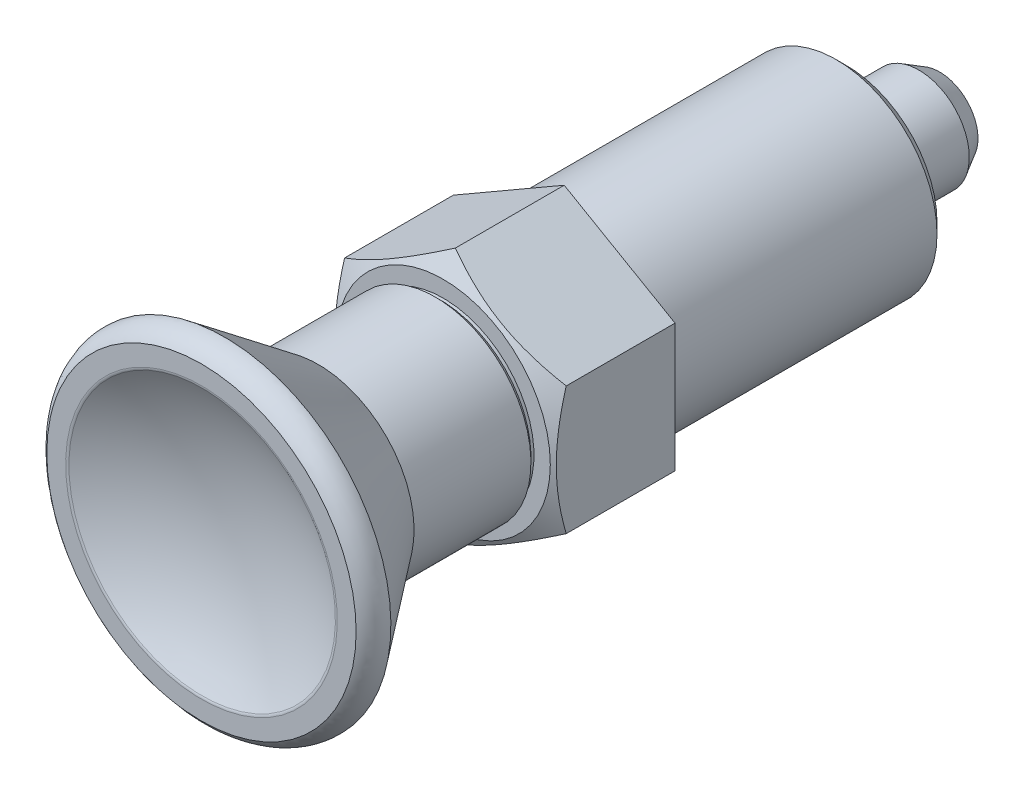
ISO-10303-21;
HEADER;
FILE_DESCRIPTION(('STEP AP214'),'2;1');
FILE_NAME('part.step','',(''),(''),'','','');
FILE_SCHEMA(('AUTOMOTIVE_DESIGN { 1 0 10303 214 1 1 1 1 }'));
ENDSEC;
DATA;
#1=APPLICATION_CONTEXT('core data for automotive mechanical design processes');
#2=APPLICATION_PROTOCOL_DEFINITION('international standard','automotive_design',2000,#1);
#3=PRODUCT_CONTEXT('',#1,'mechanical');
#4=PRODUCT('Part','Part','',(#3));
#5=PRODUCT_RELATED_PRODUCT_CATEGORY('part','',(#4));
#6=PRODUCT_DEFINITION_FORMATION('','',#4);
#7=PRODUCT_DEFINITION_CONTEXT('part definition',#1,'design');
#8=PRODUCT_DEFINITION('design','',#6,#7);
#9=PRODUCT_DEFINITION_SHAPE('','',#8);
#10=(LENGTH_UNIT() NAMED_UNIT(*) SI_UNIT(.MILLI.,.METRE.));
#11=(NAMED_UNIT(*) PLANE_ANGLE_UNIT() SI_UNIT($,.RADIAN.));
#12=(NAMED_UNIT(*) SI_UNIT($,.STERADIAN.) SOLID_ANGLE_UNIT());
#13=UNCERTAINTY_MEASURE_WITH_UNIT(LENGTH_MEASURE(1.E-05),#10,'distance_accuracy_value','');
#14=(GEOMETRIC_REPRESENTATION_CONTEXT(3) GLOBAL_UNCERTAINTY_ASSIGNED_CONTEXT((#13)) GLOBAL_UNIT_ASSIGNED_CONTEXT((#10,
#11,#12)) REPRESENTATION_CONTEXT('',''));
#15=CARTESIAN_POINT('',(0.,0.,0.));
#16=DIRECTION('',(0.,0.,1.));
#17=DIRECTION('',(1.,0.,0.));
#18=AXIS2_PLACEMENT_3D('',#15,#16,#17);
#19=CARTESIAN_POINT('',(-8.00419089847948,2.14471648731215,-28.));
#20=DIRECTION('',(0.,0.,-1.));
#21=DIRECTION('',(0.866025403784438,0.5,0.));
#22=AXIS2_PLACEMENT_3D('',#19,#20,#21);
#23=PLANE('',#22);
#24=CARTESIAN_POINT('',(1.09247082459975E-13,0.,-28.));
#25=DIRECTION('',(0.,0.,1.));
#26=DIRECTION('',(0.866025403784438,0.5,0.));
#27=AXIS2_PLACEMENT_3D('',#24,#25,#26);
#28=CIRCLE('',#27,5.1);
#29=CARTESIAN_POINT('',(4.41672955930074,2.55000000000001,-28.));
#30=VERTEX_POINT('',#29);
#31=EDGE_CURVE('E124',#30,#30,#28,.T.);
#32=ORIENTED_EDGE('',*,*,#31,.T.);
#33=EDGE_LOOP('',(#32));
#34=FACE_BOUND('',#33,.T.);
#35=CARTESIAN_POINT('',(0.,0.,-28.));
#36=DIRECTION('',(0.,0.,1.));
#37=DIRECTION('',(-0.5,0.866025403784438,0.));
#38=AXIS2_PLACEMENT_3D('',#35,#36,#37);
#39=CIRCLE('',#38,9.);
#40=CARTESIAN_POINT('',(-4.49999999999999,7.79422863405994,-28.));
#41=VERTEX_POINT('',#40);
#42=EDGE_CURVE('E361',#41,#41,#39,.T.);
#43=ORIENTED_EDGE('',*,*,#42,.F.);
#44=EDGE_LOOP('',(#43));
#45=FACE_BOUND('',#44,.T.);
#46=ADVANCED_FACE('F14',(#34,#45),#23,.T.);
#47=CARTESIAN_POINT('',(1.14891237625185E-13,0.,-28.2));
#48=DIRECTION('',(0.,0.,-1.));
#49=DIRECTION('',(-0.5,0.866025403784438,0.));
#50=AXIS2_PLACEMENT_3D('',#47,#48,#49);
#51=TOROIDAL_SURFACE('',#50,5.09999999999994,0.199999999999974);
#52=ORIENTED_EDGE('',*,*,#31,.F.);
#53=EDGE_LOOP('',(#52));
#54=FACE_BOUND('',#53,.T.);
#55=CARTESIAN_POINT('',(1.11517225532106E-13,0.,-28.2));
#56=DIRECTION('',(0.,0.,1.));
#57=DIRECTION('',(0.866025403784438,0.5,0.));
#58=AXIS2_PLACEMENT_3D('',#55,#56,#57);
#59=CIRCLE('',#58,4.9);
#60=CARTESIAN_POINT('',(4.24352447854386,2.45000000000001,-28.2));
#61=VERTEX_POINT('',#60);
#62=EDGE_CURVE('E445',#61,#61,#59,.T.);
#63=ORIENTED_EDGE('',*,*,#62,.T.);
#64=EDGE_LOOP('',(#63));
#65=FACE_BOUND('',#64,.T.);
#66=ADVANCED_FACE('F427',(#54,#65),#51,.F.);
#67=CARTESIAN_POINT('',(1.09429286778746E-13,0.,-28.2));
#68=DIRECTION('',(0.,0.,-1.));
#69=DIRECTION('',(0.866025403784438,0.5,0.));
#70=AXIS2_PLACEMENT_3D('',#67,#68,#69);
#71=CYLINDRICAL_SURFACE('',#70,4.9);
#72=CARTESIAN_POINT('',(4.24352447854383,2.45,-28.2732050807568));
#73=CARTESIAN_POINT('',(4.27911841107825,2.38834909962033,-28.2732050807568));
#74=CARTESIAN_POINT('',(4.31335718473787,2.32591678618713,-28.2732050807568));
#75=CARTESIAN_POINT('',(4.37908990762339,2.19959205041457,-28.2732050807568));
#76=CARTESIAN_POINT('',(4.41058276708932,2.13569906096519,-28.2732050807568));
#77=CARTESIAN_POINT('',(4.47077014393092,2.00658489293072,-28.2732050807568));
#78=CARTESIAN_POINT('',(4.49946380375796,1.94136331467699,-28.2732050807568));
#79=CARTESIAN_POINT('',(4.55399926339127,1.80972322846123,-28.2732050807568));
#80=CARTESIAN_POINT('',(4.57984048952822,1.74330448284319,-28.2732050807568));
#81=CARTESIAN_POINT('',(4.62861730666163,1.60940145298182,-28.2732050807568));
#82=CARTESIAN_POINT('',(4.65155262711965,1.54191707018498,-28.2732050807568));
#83=CARTESIAN_POINT('',(4.69446457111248,1.40601433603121,-28.2732050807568));
#84=CARTESIAN_POINT('',(4.71444121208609,1.33759599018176,-28.2732050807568));
#85=CARTESIAN_POINT('',(4.7513800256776,1.19995617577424,-28.2732050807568));
#86=CARTESIAN_POINT('',(4.76834245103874,1.13073477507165,-28.2732050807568));
#87=CARTESIAN_POINT('',(4.79920830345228,0.991620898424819,-28.2732050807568));
#88=CARTESIAN_POINT('',(4.81311204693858,0.921728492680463,-28.2732050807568));
#89=CARTESIAN_POINT('',(4.83785420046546,0.781408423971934,-28.2732050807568));
#90=CARTESIAN_POINT('',(4.84869282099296,0.710980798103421,-28.2732050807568));
#91=CARTESIAN_POINT('',(4.867293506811,0.569724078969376,-28.2732050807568));
#92=CARTESIAN_POINT('',(4.87505572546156,0.498895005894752,-28.2732050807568));
#93=CARTESIAN_POINT('',(4.8874937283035,0.356969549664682,-28.2732050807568));
#94=CARTESIAN_POINT('',(4.89216964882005,0.285873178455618,-28.2732050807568));
#95=CARTESIAN_POINT('',(4.89842442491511,0.143547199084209,-28.2732050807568));
#96=CARTESIAN_POINT('',(4.90000340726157,0.0723175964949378,-28.2732050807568));
#97=CARTESIAN_POINT('',(4.90005509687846,-0.0701408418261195,-28.2732050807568));
#98=CARTESIAN_POINT('',(4.89852789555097,-0.141369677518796,-28.2732050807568));
#99=CARTESIAN_POINT('',(4.89235303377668,-0.283692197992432,-28.2732050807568));
#100=CARTESIAN_POINT('',(4.88770537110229,-0.354785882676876,-28.2732050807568));
#101=CARTESIAN_POINT('',(4.87529882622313,-0.496703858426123,-28.2732050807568));
#102=CARTESIAN_POINT('',(4.86753982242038,-0.567528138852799,-28.2732050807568));
#103=CARTESIAN_POINT('',(4.84894396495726,-0.708774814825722,-28.2732050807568));
#104=CARTESIAN_POINT('',(4.83810695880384,-0.779197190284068,-28.2732050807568));
#105=CARTESIAN_POINT('',(4.81338324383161,-0.919507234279,-28.2732050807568));
#106=CARTESIAN_POINT('',(4.79949641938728,-0.989394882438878,-28.2732050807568));
#107=CARTESIAN_POINT('',(4.76870259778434,-1.12850274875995,-28.2732050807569));
#108=CARTESIAN_POINT('',(4.75179555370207,-1.19772295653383,-28.2732050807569));
#109=CARTESIAN_POINT('',(4.71499011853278,-1.33536305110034,-28.2732050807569));
#110=CARTESIAN_POINT('',(4.69509174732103,-1.40378294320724,-28.2732050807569));
#111=CARTESIAN_POINT('',(4.65233372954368,-1.5396900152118,-28.2732050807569));
#112=CARTESIAN_POINT('',(4.62947413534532,-1.60717721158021,-28.2732050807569));
#113=CARTESIAN_POINT('',(4.58081947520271,-1.74108463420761,-28.2732050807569));
#114=CARTESIAN_POINT('',(4.55502442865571,-1.80750486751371,-28.2732050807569));
#115=CARTESIAN_POINT('',(4.50055489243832,-1.93915523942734,-28.2732050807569));
#116=CARTESIAN_POINT('',(4.4718803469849,-2.0043853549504,-28.2732050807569));
#117=CARTESIAN_POINT('',(4.41171744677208,-2.13353694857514,-28.2732050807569));
#118=CARTESIAN_POINT('',(4.3802290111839,-2.19745838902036,-28.2732050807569));
#119=CARTESIAN_POINT('',(4.31450142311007,-2.32387303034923,-28.2732050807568));
#120=CARTESIAN_POINT('',(4.28026220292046,-2.38636619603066,-28.2732050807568));
#121=CARTESIAN_POINT('',(4.20909676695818,-2.50980495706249,-28.2732050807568));
#122=CARTESIAN_POINT('',(4.17217050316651,-2.57075052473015,-28.2732050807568));
#123=CARTESIAN_POINT('',(4.09569450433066,-2.69097461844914,-28.2732050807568));
#124=CARTESIAN_POINT('',(4.05614471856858,-2.75025311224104,-28.2732050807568));
#125=CARTESIAN_POINT('',(3.9744853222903,-2.86702384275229,-28.2732050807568));
#126=CARTESIAN_POINT('',(3.93237560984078,-2.92451600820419,-28.2732050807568));
#127=CARTESIAN_POINT('',(3.84566005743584,-3.03759378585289,-28.2732050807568));
#128=CARTESIAN_POINT('',(3.80105400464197,-3.09317923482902,-28.2732050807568));
#129=CARTESIAN_POINT('',(3.70944732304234,-3.20235131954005,-28.2732050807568));
#130=CARTESIAN_POINT('',(3.6624464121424,-3.25593771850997,-28.2732050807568));
#131=CARTESIAN_POINT('',(3.56615170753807,-3.36102024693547,-28.2732050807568));
#132=CARTESIAN_POINT('',(3.51685765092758,-3.4125161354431,-28.2732050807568));
#133=CARTESIAN_POINT('',(3.41607820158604,-3.51332587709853,-28.2732050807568));
#134=CARTESIAN_POINT('',(3.36459261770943,-3.56263953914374,-28.2732050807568));
#135=CARTESIAN_POINT('',(3.25953161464,-3.65899304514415,-28.2732050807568));
#136=CARTESIAN_POINT('',(3.2059560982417,-3.7060327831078,-28.2732050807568));
#137=CARTESIAN_POINT('',(3.09681676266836,-3.79774669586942,-28.2732050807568));
#138=CARTESIAN_POINT('',(3.04125293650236,-3.84242086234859,-28.2732050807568));
#139=CARTESIAN_POINT('',(2.92823830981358,-3.92931153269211,-28.2732050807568));
#140=CARTESIAN_POINT('',(2.87078756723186,-3.97152811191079,-28.2732050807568));
#141=CARTESIAN_POINT('',(2.75410124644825,-4.05341280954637,-28.2732050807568));
#142=CARTESIAN_POINT('',(2.69486574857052,-4.09308104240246,-28.2732050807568));
#143=CARTESIAN_POINT('',(2.57470916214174,-4.1697734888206,-28.2732050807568));
#144=CARTESIAN_POINT('',(2.51378812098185,-4.20679777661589,-28.2732050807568));
#145=CARTESIAN_POINT('',(2.39037321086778,-4.27812743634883,-28.2732050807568));
#146=CARTESIAN_POINT('',(2.32787931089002,-4.31243275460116,-28.2732050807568));
#147=CARTESIAN_POINT('',(2.20144908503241,-4.378281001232,-28.2732050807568));
#148=CARTESIAN_POINT('',(2.13751268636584,-4.40982378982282,-28.2732050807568));
#149=CARTESIAN_POINT('',(2.00832409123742,-4.47009757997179,-28.2732050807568));
#150=CARTESIAN_POINT('',(1.94307182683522,-4.49882843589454,-28.2732050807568));
#151=CARTESIAN_POINT('',(1.81137907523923,-4.55343044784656,-28.2732050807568));
#152=CARTESIAN_POINT('',(1.74493854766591,-4.57930150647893,-28.2732050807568));
#153=CARTESIAN_POINT('',(1.61099655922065,-4.62813551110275,-28.2732050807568));
#154=CARTESIAN_POINT('',(1.54349508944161,-4.65109843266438,-28.2732050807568));
#155=CARTESIAN_POINT('',(1.40755858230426,-4.69406793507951,-28.2732050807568));
#156=CARTESIAN_POINT('',(1.33912355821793,-4.71407455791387,-28.2732050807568));
#157=CARTESIAN_POINT('',(1.20144727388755,-4.75108284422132,-28.2732050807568));
#158=CARTESIAN_POINT('',(1.13220603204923,-4.76808457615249,-28.2732050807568));
#159=CARTESIAN_POINT('',(0.993044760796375,-4.79903587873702,-28.2732050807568));
#160=CARTESIAN_POINT('',(0.923124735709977,-4.81298546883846,-28.2732050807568));
#161=CARTESIAN_POINT('',(0.78273314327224,-4.83778022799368,-28.2732050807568));
#162=CARTESIAN_POINT('',(0.712261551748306,-4.84862526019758,-28.2732050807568));
#163=CARTESIAN_POINT('',(0.570903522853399,-4.86720972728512,-28.2732050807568));
#164=CARTESIAN_POINT('',(0.500017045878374,-4.87494886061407,-28.2732050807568));
#165=CARTESIAN_POINT('',(0.357966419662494,-4.88732871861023,-28.2732050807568));
#166=CARTESIAN_POINT('',(0.286802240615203,-4.89196910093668,-28.2732050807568));
#167=CARTESIAN_POINT('',(0.144333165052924,-4.89815629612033,-28.2732050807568));
#168=CARTESIAN_POINT('',(0.0730282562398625,-4.89970282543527,-28.2732050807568));
#169=CARTESIAN_POINT('',(-0.0695852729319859,-4.89970765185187,-28.2732050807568));
#170=CARTESIAN_POINT('',(-0.140893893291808,-4.89816578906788,-28.2732050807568));
#171=CARTESIAN_POINT('',(-0.283377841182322,-4.89199892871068,-28.2732050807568));
#172=CARTESIAN_POINT('',(-0.354553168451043,-4.88737392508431,-28.2732050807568));
#173=CARTESIAN_POINT('',(-0.496633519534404,-4.87504595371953,-28.2732050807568));
#174=CARTESIAN_POINT('',(-0.567538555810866,-4.86734312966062,-28.2732050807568));
#175=CARTESIAN_POINT('',(-0.708941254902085,-4.84886445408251,-28.2732050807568));
#176=CARTESIAN_POINT('',(-0.779438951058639,-4.83808885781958,-28.2732050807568));
#177=CARTESIAN_POINT('',(-0.91989006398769,-4.81347046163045,-28.2732050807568));
#178=CARTESIAN_POINT('',(-0.98984353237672,-4.79962795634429,-28.2732050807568));
#179=CARTESIAN_POINT('',(-1.12906864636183,-4.76887848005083,-28.2732050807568));
#180=CARTESIAN_POINT('',(-1.19834034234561,-4.75197173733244,-28.2732050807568));
#181=CARTESIAN_POINT('',(-1.33606646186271,-4.71510904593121,-28.2732050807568));
#182=CARTESIAN_POINT('',(-1.40452089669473,-4.69515313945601,-28.2732050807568));
#183=CARTESIAN_POINT('',(-1.54049076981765,-4.6522576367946,-28.2732050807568));
#184=CARTESIAN_POINT('',(-1.60800617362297,-4.62931793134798,-28.2732050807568));
#185=CARTESIAN_POINT('',(-1.74197514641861,-4.58051384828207,-28.2732050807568));
#186=CARTESIAN_POINT('',(-1.80842866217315,-4.55464932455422,-28.2732050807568));
#187=CARTESIAN_POINT('',(-1.9401512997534,-4.50005620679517,-28.2732050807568));
#188=CARTESIAN_POINT('',(-2.0054203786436,-4.47132750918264,-28.2732050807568));
#189=CARTESIAN_POINT('',(-2.13465145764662,-4.41106610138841,-28.2732050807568));
#190=CARTESIAN_POINT('',(-2.19861344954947,-4.3795333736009,-28.2732050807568));
#191=CARTESIAN_POINT('',(-2.32510769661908,-4.31372409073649,-28.2732050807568));
#192=CARTESIAN_POINT('',(-2.38763999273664,-4.27944761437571,-28.2732050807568));
#193=CARTESIAN_POINT('',(-2.51115204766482,-4.20821079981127,-28.2732050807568));
#194=CARTESIAN_POINT('',(-2.57213189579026,-4.17125061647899,-28.2732050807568));
#195=CARTESIAN_POINT('',(-2.69241670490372,-4.09470704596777,-28.2732050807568));
#196=CARTESIAN_POINT('',(-2.75172178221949,-4.05512384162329,-28.2732050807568));
#197=CARTESIAN_POINT('',(-2.86853304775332,-3.97339245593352,-28.2732050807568));
#198=CARTESIAN_POINT('',(-2.92603933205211,-3.931244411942,-28.2732050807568));
#199=CARTESIAN_POINT('',(-3.03913534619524,-3.84445149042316,-28.2732050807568));
#200=CARTESIAN_POINT('',(-3.0947250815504,-3.79980662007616,-28.2732050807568));
#201=CARTESIAN_POINT('',(-3.2038997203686,-3.70812571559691,-28.2732050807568));
#202=CARTESIAN_POINT('',(-3.25748454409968,-3.6610895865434,-28.2732050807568));
#203=CARTESIAN_POINT('',(-3.36255785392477,-3.56472668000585,-28.2732050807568));
#204=CARTESIAN_POINT('',(-3.41404623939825,-3.51539979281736,-28.2732050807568));
#205=CARTESIAN_POINT('',(-3.51483596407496,-3.41455713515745,-28.2732050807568));
#206=CARTESIAN_POINT('',(-3.56413723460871,-3.36304129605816,-28.2732050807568));
#207=CARTESIAN_POINT('',(-3.66046171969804,-3.25792208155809,-28.2732050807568));
#208=CARTESIAN_POINT('',(-3.70748493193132,-3.20431870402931,-28.2732050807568));
#209=CARTESIAN_POINT('',(-3.79916236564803,-3.09512586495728,-28.2732050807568));
#210=CARTESIAN_POINT('',(-3.84381666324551,-3.0395364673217,-28.2732050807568));
#211=CARTESIAN_POINT('',(-3.9306651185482,-2.92647289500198,-28.2732050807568));
#212=CARTESIAN_POINT('',(-3.97285941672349,-2.86899882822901,-28.2732050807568));
#213=CARTESIAN_POINT('',(-4.05469743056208,-2.75226770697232,-28.2732050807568));
#214=CARTESIAN_POINT('',(-4.09434130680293,-2.69301076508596,-28.2732050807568));
#215=CARTESIAN_POINT('',(-4.17098550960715,-2.57281402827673,-28.2732050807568));
#216=CARTESIAN_POINT('',(-4.20798593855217,-2.51187429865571,-28.2732050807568));
#217=CARTESIAN_POINT('',(-4.27926006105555,-2.38841933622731,-28.2732050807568));
#218=CARTESIAN_POINT('',(-4.31353370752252,-2.32590407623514,-28.2732050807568));
#219=CARTESIAN_POINT('',(-4.37931275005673,-2.19942972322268,-28.2732050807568));
#220=CARTESIAN_POINT('',(-4.41081799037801,-2.13547054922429,-28.2732050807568));
#221=CARTESIAN_POINT('',(-4.47101358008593,-2.00623651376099,-28.2732050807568));
#222=CARTESIAN_POINT('',(-4.49970376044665,-1.94096157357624,-28.2732050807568));
#223=CARTESIAN_POINT('',(-4.55422384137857,-1.80922502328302,-28.2732050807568));
#224=CARTESIAN_POINT('',(-4.5800536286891,-1.74276336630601,-28.2732050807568));
#225=CARTESIAN_POINT('',(-4.62880707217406,-1.60878212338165,-28.2732050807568));
#226=CARTESIAN_POINT('',(-4.65173071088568,-1.54126253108,-28.2732050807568));
#227=CARTESIAN_POINT('',(-4.69462618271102,-1.4052942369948,-28.2732050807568));
#228=CARTESIAN_POINT('',(-4.71459810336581,-1.33684556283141,-28.2732050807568));
#229=CARTESIAN_POINT('',(-4.75154397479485,-1.19914784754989,-28.2732050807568));
#230=CARTESIAN_POINT('',(-4.76851809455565,-1.12989885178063,-28.2732050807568));
#231=CARTESIAN_POINT('',(-4.79942392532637,-0.990729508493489,-28.2732050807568));
#232=CARTESIAN_POINT('',(-4.81335582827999,-0.920809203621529,-28.2732050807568));
#233=CARTESIAN_POINT('',(-4.83812651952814,-0.780425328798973,-28.2732050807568));
#234=CARTESIAN_POINT('',(-4.84896542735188,-0.709961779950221,-28.2732050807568));
#235=CARTESIAN_POINT('',(-4.86752835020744,-0.56862478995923,-28.2732050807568));
#236=CARTESIAN_POINT('',(-4.87525231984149,-0.497751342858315,-28.2732050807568));
#237=CARTESIAN_POINT('',(-4.88759665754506,-0.355731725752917,-28.2732050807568));
#238=CARTESIAN_POINT('',(-4.89221688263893,-0.284585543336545,-28.2732050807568));
#239=CARTESIAN_POINT('',(-4.89835813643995,-0.142156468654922,-28.2732050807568));
#240=CARTESIAN_POINT('',(-4.89987902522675,-0.0708735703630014,-28.2732050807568));
#241=CARTESIAN_POINT('',(-4.89982772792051,0.0716926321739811,-28.2732050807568));
#242=CARTESIAN_POINT('',(-4.89825547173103,0.142975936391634,-28.2732050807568));
#243=CARTESIAN_POINT('',(-4.89202342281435,0.285406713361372,-28.2732050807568));
#244=CARTESIAN_POINT('',(-4.88736366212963,0.356554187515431,-28.2732050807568));
#245=CARTESIAN_POINT('',(-4.87496235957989,0.498577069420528,-28.2732050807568));
#246=CARTESIAN_POINT('',(-4.86722095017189,0.569452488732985,-28.2732050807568));
#247=CARTESIAN_POINT('',(-4.84866162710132,0.710794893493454,-28.2732050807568));
#248=CARTESIAN_POINT('',(-4.83784391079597,0.781261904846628,-28.2732050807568));
#249=CARTESIAN_POINT('',(-4.81313895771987,0.921651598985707,-28.2732050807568));
#250=CARTESIAN_POINT('',(-4.7992519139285,0.991574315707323,-28.2732050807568));
#251=CARTESIAN_POINT('',(-4.76840915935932,1.13073772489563,-28.2732050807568));
#252=CARTESIAN_POINT('',(-4.7514535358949,1.19997843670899,-28.2732050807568));
#253=CARTESIAN_POINT('',(-4.71451691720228,1.33764947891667,-28.2732050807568));
#254=CARTESIAN_POINT('',(-4.69453585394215,1.40607979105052,-28.2732050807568));
#255=CARTESIAN_POINT('',(-4.65160610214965,1.54200619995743,-28.2732050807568));
#256=CARTESIAN_POINT('',(-4.6286572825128,1.60950225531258,-28.2732050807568));
#257=CARTESIAN_POINT('',(-4.57984598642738,1.74343530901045,-28.2732050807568));
#258=CARTESIAN_POINT('',(-4.55398339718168,1.80987226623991,-28.2732050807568));
#259=CARTESIAN_POINT('',(-4.49939941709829,1.9415625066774,-28.2732050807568));
#260=CARTESIAN_POINT('',(-4.47067797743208,2.00681576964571,-28.2732050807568));
#261=CARTESIAN_POINT('',(-4.41043090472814,2.13601394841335,-28.2732050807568));
#262=CARTESIAN_POINT('',(-4.37890529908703,2.19995887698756,-28.2732050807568));
#263=CARTESIAN_POINT('',(-4.31310433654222,2.32641557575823,-28.2732050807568));
#264=CARTESIAN_POINT('',(-4.27882906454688,2.38892739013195,-28.2732050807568));
#265=CARTESIAN_POINT('',(-4.20758405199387,2.51239357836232,-28.2732050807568));
#266=CARTESIAN_POINT('',(-4.17061440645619,2.57334800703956,-28.2732050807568));
#267=CARTESIAN_POINT('',(-4.09403284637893,2.6935731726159,-28.2732050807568));
#268=CARTESIAN_POINT('',(-4.05442096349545,2.75284392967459,-28.2732050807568));
#269=CARTESIAN_POINT('',(-3.97262027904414,2.86958265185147,-28.2732050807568));
#270=CARTESIAN_POINT('',(-3.93043138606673,2.92705055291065,-28.2732050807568));
#271=CARTESIAN_POINT('',(-3.84357906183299,3.04008958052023,-28.2732050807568));
#272=CARTESIAN_POINT('',(-3.79891549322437,3.09566060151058,-28.2732050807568));
#273=CARTESIAN_POINT('',(-3.70721055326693,3.20480837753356,-28.2732050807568));
#274=CARTESIAN_POINT('',(-3.66016908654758,3.25838505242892,-28.2732050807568));
#275=CARTESIAN_POINT('',(-3.56380649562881,3.36344748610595,-28.2732050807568));
#276=CARTESIAN_POINT('',(-3.51448536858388,3.41493324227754,-28.2732050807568));
#277=CARTESIAN_POINT('',(-3.41366114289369,3.51571686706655,-28.2732050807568));
#278=CARTESIAN_POINT('',(-3.36215815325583,3.56501484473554,-28.2732050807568));
#279=CARTESIAN_POINT('',(-3.25706802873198,3.66132605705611,-28.2732050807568));
#280=CARTESIAN_POINT('',(-3.20348110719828,3.70833952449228,-28.2732050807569));
#281=CARTESIAN_POINT('',(-3.09432073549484,3.79998450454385,-28.2732050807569));
#282=CARTESIAN_POINT('',(-3.038747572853,3.84461635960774,-28.2732050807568));
#283=CARTESIAN_POINT('',(-2.92571308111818,3.93140213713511,-28.2732050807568));
#284=CARTESIAN_POINT('',(-2.86825206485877,3.97355646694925,-28.2732050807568));
#285=CARTESIAN_POINT('',(-2.75153745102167,4.05528685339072,-28.2732050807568));
#286=CARTESIAN_POINT('',(-2.69228412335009,4.09486329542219,-28.2732050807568));
#287=CARTESIAN_POINT('',(-2.57210417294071,4.17137479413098,-28.2732050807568));
#288=CARTESIAN_POINT('',(-2.51117770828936,4.20831009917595,-28.2732050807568));
#289=CARTESIAN_POINT('',(-2.387774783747,4.27948535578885,-28.2732050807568));
#290=CARTESIAN_POINT('',(-2.32529840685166,4.31372545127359,-28.2732050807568));
#291=CARTESIAN_POINT('',(-2.19891758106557,4.37945411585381,-28.2732050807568));
#292=CARTESIAN_POINT('',(-2.13501318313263,4.41094278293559,-28.2732050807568));
#293=CARTESIAN_POINT('',(-2.00589850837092,4.47111276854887,-28.2732050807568));
#294=CARTESIAN_POINT('',(-1.94068827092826,4.49979417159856,-28.2732050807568));
#295=CARTESIAN_POINT('',(-1.80908416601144,4.554294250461,-28.2732050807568));
#296=CARTESIAN_POINT('',(-1.74269032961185,4.58011300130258,-28.2732050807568));
#297=CARTESIAN_POINT('',(-1.60884066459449,4.62883007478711,-28.2732050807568));
#298=CARTESIAN_POINT('',(-1.54138484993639,4.65172843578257,-28.2732050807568));
#299=CARTESIAN_POINT('',(-1.40554010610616,4.69456757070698,-28.2732050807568));
#300=CARTESIAN_POINT('',(-1.33715116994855,4.71450832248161,-28.2732050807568));
#301=CARTESIAN_POINT('',(-1.19956997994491,4.75139934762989,-28.2732050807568));
#302=CARTESIAN_POINT('',(-1.13037771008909,4.76834956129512,-28.2732050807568));
#303=CARTESIAN_POINT('',(-0.991319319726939,4.79922557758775,-28.2732050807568));
#304=CARTESIAN_POINT('',(-0.921453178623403,4.81315128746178,-28.2732050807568));
#305=CARTESIAN_POINT('',(-0.781176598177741,4.83794431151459,-28.2732050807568));
#306=CARTESIAN_POINT('',(-0.71076613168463,4.84881147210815,-28.2732050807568));
#307=CARTESIAN_POINT('',(-0.569530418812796,4.86745463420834,-28.2732050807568));
#308=CARTESIAN_POINT('',(-0.498705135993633,4.87523035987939,-28.2732050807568));
#309=CARTESIAN_POINT('',(-0.356769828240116,4.88765318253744,-28.2732050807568));
#310=CARTESIAN_POINT('',(-0.285659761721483,4.89229980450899,-28.2732050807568));
#311=CARTESIAN_POINT('',(-0.143291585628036,4.89847210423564,-28.2732050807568));
#312=CARTESIAN_POINT('',(-0.0720334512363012,4.89999720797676,-28.2732050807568));
#313=CARTESIAN_POINT('',(0.0704933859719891,4.8999421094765,-28.2732050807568));
#314=CARTESIAN_POINT('',(0.141762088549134,4.89836138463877,-28.2732050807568));
#315=CARTESIAN_POINT('',(0.284172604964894,4.89210801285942,-28.2732050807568));
#316=CARTESIAN_POINT('',(0.355314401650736,4.88743497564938,-28.2732050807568));
#317=CARTESIAN_POINT('',(0.497333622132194,4.87501082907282,-28.2732050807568));
#318=CARTESIAN_POINT('',(0.568211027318,4.86725950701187,-28.2732050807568));
#319=CARTESIAN_POINT('',(0.709563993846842,4.84869254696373,-28.2732050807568));
#320=CARTESIAN_POINT('',(0.780039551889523,4.8378768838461,-28.2732050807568));
#321=CARTESIAN_POINT('',(0.920451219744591,4.81319463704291,-28.2732050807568));
#322=CARTESIAN_POINT('',(0.990387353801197,4.79932819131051,-28.2732050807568));
#323=CARTESIAN_POINT('',(1.12958298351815,4.76855925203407,-28.2732050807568));
#324=CARTESIAN_POINT('',(1.19884253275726,4.75165700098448,-28.2732050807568));
#325=CARTESIAN_POINT('',(1.33654625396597,4.71482590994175,-28.2732050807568));
#326=CARTESIAN_POINT('',(1.40499049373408,4.69489732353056,-28.2732050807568));
#327=CARTESIAN_POINT('',(1.54093238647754,4.65204704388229,-28.2732050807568));
#328=CARTESIAN_POINT('',(1.60843007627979,4.6291254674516,-28.2732050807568));
#329=CARTESIAN_POINT('',(1.74236005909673,4.58035516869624,-28.2732050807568));
#330=CARTESIAN_POINT('',(1.80879234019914,4.554506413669,-28.2732050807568));
#331=CARTESIAN_POINT('',(1.94047100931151,4.49994108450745,-28.2732050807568));
#332=CARTESIAN_POINT('',(2.00571735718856,4.47122441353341,-28.2732050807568));
#333=CARTESIAN_POINT('',(2.13490411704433,4.41098423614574,-28.2732050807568));
#334=CARTESIAN_POINT('',(2.19884447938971,4.37946062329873,-28.2732050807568));
#335=CARTESIAN_POINT('',(2.3252990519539,4.31366699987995,-28.2732050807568));
#336=CARTESIAN_POINT('',(2.38781321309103,4.27939689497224,-28.2732050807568));
#337=CARTESIAN_POINT('',(2.5112952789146,4.20817093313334,-28.2732050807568));
#338=CARTESIAN_POINT('',(2.57226313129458,4.17121498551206,-28.2732050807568));
#339=CARTESIAN_POINT('',(2.69253213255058,4.09467757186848,-28.2732050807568));
#340=CARTESIAN_POINT('',(2.75183320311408,4.05509598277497,-28.2732050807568));
#341=CARTESIAN_POINT('',(2.86864947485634,3.97336901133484,-28.2732050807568));
#342=CARTESIAN_POINT('',(2.92616452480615,3.93122341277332,-28.2732050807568));
#343=CARTESIAN_POINT('',(3.03928454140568,3.84442511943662,-28.2732050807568));
#344=CARTESIAN_POINT('',(3.09488922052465,3.79977204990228,-28.2732050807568));
#345=CARTESIAN_POINT('',(3.20408910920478,3.70805592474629,-28.2732050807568));
#346=CARTESIAN_POINT('',(3.2576839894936,3.66099247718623,-28.2732050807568));
#347=CARTESIAN_POINT('',(3.36277431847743,3.56456716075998,-28.2732050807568));
#348=CARTESIAN_POINT('',(3.41426955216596,3.51520505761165,-28.2732050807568));
#349=CARTESIAN_POINT('',(3.51506769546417,3.41429057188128,-28.2732050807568));
#350=CARTESIAN_POINT('',(3.56437058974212,3.36273817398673,-28.2732050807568));
#351=CARTESIAN_POINT('',(3.66069181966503,3.25755208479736,-28.2732050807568));
#352=CARTESIAN_POINT('',(3.70771040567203,3.20391862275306,-28.2732050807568));
#353=CARTESIAN_POINT('',(3.79937052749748,3.09467911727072,-28.2732050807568));
#354=CARTESIAN_POINT('',(3.8440126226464,3.03907354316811,-28.2732050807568));
#355=CARTESIAN_POINT('',(3.9308272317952,2.92599863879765,-28.2732050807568));
#356=CARTESIAN_POINT('',(3.97300063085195,2.8685299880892,-28.2732050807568));
#357=CARTESIAN_POINT('',(4.05478546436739,2.75183761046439,-28.2732050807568));
#358=CARTESIAN_POINT('',(4.09439809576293,2.69261472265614,-28.2732050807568));
#359=CARTESIAN_POINT('',(4.1709683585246,2.5725231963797,-28.2732050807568));
#360=CARTESIAN_POINT('',(4.20792745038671,2.51165548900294,-28.2732050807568));
#361=CARTESIAN_POINT('',(4.24352447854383,2.45,-28.2732050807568));
#362=B_SPLINE_CURVE_WITH_KNOTS('',3,(#72,#73,#74,#75,#76,#77,#78,#79,#80,#81,#82,#83,#84,#85,
#86,#87,#88,#89,#90,#91,#92,#93,#94,#95,#96,#97,#98,#99,#100,#101,#102,#103,#104,#105,#106,#107,
#108,#109,#110,#111,#112,#113,#114,#115,#116,#117,#118,#119,#120,#121,#122,#123,#124,#125,#126,
#127,#128,#129,#130,#131,#132,#133,#134,#135,#136,#137,#138,#139,#140,#141,#142,#143,#144,#145,
#146,#147,#148,#149,#150,#151,#152,#153,#154,#155,#156,#157,#158,#159,#160,#161,#162,#163,#164,
#165,#166,#167,#168,#169,#170,#171,#172,#173,#174,#175,#176,#177,#178,#179,#180,#181,#182,#183,
#184,#185,#186,#187,#188,#189,#190,#191,#192,#193,#194,#195,#196,#197,#198,#199,#200,#201,#202,
#203,#204,#205,#206,#207,#208,#209,#210,#211,#212,#213,#214,#215,#216,#217,#218,#219,#220,#221,
#222,#223,#224,#225,#226,#227,#228,#229,#230,#231,#232,#233,#234,#235,#236,#237,#238,#239,#240,
#241,#242,#243,#244,#245,#246,#247,#248,#249,#250,#251,#252,#253,#254,#255,#256,#257,#258,#259,
#260,#261,#262,#263,#264,#265,#266,#267,#268,#269,#270,#271,#272,#273,#274,#275,#276,#277,#278,
#279,#280,#281,#282,#283,#284,#285,#286,#287,#288,#289,#290,#291,#292,#293,#294,#295,#296,#297,
#298,#299,#300,#301,#302,#303,#304,#305,#306,#307,#308,#309,#310,#311,#312,#313,#314,#315,#316,
#317,#318,#319,#320,#321,#322,#323,#324,#325,#326,#327,#328,#329,#330,#331,#332,#333,#334,#335,
#336,#337,#338,#339,#340,#341,#342,#343,#344,#345,#346,#347,#348,#349,#350,#351,#352,#353,#354,
#355,#356,#357,#358,#359,#360,#361),.UNSPECIFIED.,.F.,.F.,(4,2,2,2,2,2,2,2,2,2,2,2,2,2,2,2,2,2,
2,2,2,2,2,2,2,2,2,2,2,2,2,2,2,2,2,2,2,2,2,2,2,2,2,2,2,2,2,2,2,2,2,2,2,2,2,2,2,2,2,2,2,2,2,2,2,2,
2,2,2,2,2,2,2,2,2,2,2,2,2,2,2,2,2,2,2,2,2,2,2,2,2,2,2,2,2,2,2,2,2,2,2,2,2,2,2,2,2,2,2,2,2,2,2,2,
2,2,2,2,2,2,2,2,2,2,2,2,2,2,2,2,2,2,2,2,2,2,2,2,2,2,2,2,2,2,4),(0.,0.213546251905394,
0.427176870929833,0.640872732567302,0.854611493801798,1.06837013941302,1.28212752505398,
1.49586697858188,1.70958430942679,1.92328696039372,2.13697895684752,2.35066151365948,
2.56433532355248,2.77800284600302,2.99167052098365,3.20534654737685,3.41903316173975,
3.6327278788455,3.84642591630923,4.06012253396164,4.27381537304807,4.48750680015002,
4.70120236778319,4.91490407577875,5.12861104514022,5.34232183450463,5.55603675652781,
5.76976019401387,5.98350188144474,6.19726880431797,6.41106029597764,6.62487047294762,
6.83869060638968,7.0525114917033,7.26632581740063,7.48013053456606,7.69392924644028,
7.90773217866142,8.12154592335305,8.33537073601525,8.54920282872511,8.76303671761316,
8.97686756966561,9.19069354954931,9.40451816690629,9.61835220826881,9.83220700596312,
10.0460854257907,10.2599834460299,10.4738925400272,10.6878020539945,10.9017015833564,
11.1155833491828,11.3294445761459,11.5432898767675,11.7571322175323,11.9709823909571,
12.1848432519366,12.3987118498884,12.612581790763,12.8264455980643,13.0402970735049,
13.2541336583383,13.4679588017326,13.6817833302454,13.8956163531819,14.1094596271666,
14.3233096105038,14.5371598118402,14.7510031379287,14.964834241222,15.1786518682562,
15.3924612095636,15.6062742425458,15.8200992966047,16.0339371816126,16.247783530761,
16.4616311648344,16.6754724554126,16.8893016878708,17.1031174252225,17.316924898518,
17.5307354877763,17.7445559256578,17.9583860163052,18.1722209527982,18.3860536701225,
18.5998771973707,18.8136870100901,19.0274833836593,19.2412736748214,19.4550687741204,
19.6688733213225,19.882686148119,20.0965026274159,20.3103170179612,20.5241248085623,
20.7379250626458,20.9517227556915,21.1655280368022,21.3793451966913,21.5931709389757,
21.8069969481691,22.0208122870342,22.2346057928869,22.4483684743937,22.6620959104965,
22.8757913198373,23.0894666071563,23.3031304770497,23.5167867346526,23.7304365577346,
23.9440807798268,24.1577221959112,24.3713652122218,24.5850124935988,24.7986663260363,
25.0123308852,25.226014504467,25.4397305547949,25.653485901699,25.8672772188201,
26.0810955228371,26.2949286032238,26.5087634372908,26.7225886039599,26.9363966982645,
27.150186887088,27.3639687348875,27.5777529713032,27.7915444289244,28.0053439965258,
28.2191509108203,28.4329650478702,28.646789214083,28.8606314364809,29.0745057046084,
29.2884148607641,29.5023458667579,29.7162783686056,29.9301873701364,30.1440458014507,
30.3578270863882,30.5715077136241,30.78506981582),.UNSPECIFIED.);
#363=CARTESIAN_POINT('',(4.24352447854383,2.45,-28.2732050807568));
#364=VERTEX_POINT('',#363);
#365=EDGE_CURVE('E448',#364,#364,#362,.F.);
#366=ORIENTED_EDGE('',*,*,#365,.T.);
#367=EDGE_LOOP('',(#366));
#368=FACE_BOUND('',#367,.T.);
#369=ORIENTED_EDGE('',*,*,#62,.F.);
#370=EDGE_LOOP('',(#369));
#371=FACE_BOUND('',#370,.T.);
#372=ADVANCED_FACE('F429',(#368,#371),#71,.T.);
#373=CARTESIAN_POINT('',(4.24352447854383,2.45,-28.2732050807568));
#374=CARTESIAN_POINT('',(3.93345350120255,2.98705868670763,-28.2732050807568));
#375=CARTESIAN_POINT('',(3.10484876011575,3.94458234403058,-28.2732050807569));
#376=CARTESIAN_POINT('',(1.43959818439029,4.80422172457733,-28.2732050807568));
#377=CARTESIAN_POINT('',(-0.226510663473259,4.9769717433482,-28.2732050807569));
#378=CARTESIAN_POINT('',(-1.65736469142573,4.67024426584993,-28.2732050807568));
#379=CARTESIAN_POINT('',(-2.96525028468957,4.00439667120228,-28.2732050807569));
#380=CARTESIAN_POINT('',(-4.13865315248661,2.82843715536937,-28.2732050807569));
#381=CARTESIAN_POINT('',(-4.88871258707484,1.1253481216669,-28.2732050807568));
#382=CARTESIAN_POINT('',(-4.96315846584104,-0.756990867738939,-28.2732050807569));
#383=CARTESIAN_POINT('',(-4.31802058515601,-2.56841513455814,-28.2732050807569));
#384=CARTESIAN_POINT('',(-3.02305228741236,-4.01720768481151,-28.2732050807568));
#385=CARTESIAN_POINT('',(-1.21404253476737,-4.88880724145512,-28.2732050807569));
#386=CARTESIAN_POINT('',(0.767089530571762,-4.97207391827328,-28.2732050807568));
#387=CARTESIAN_POINT('',(2.5876040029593,-4.29659549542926,-28.2732050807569));
#388=CARTESIAN_POINT('',(3.88000178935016,-3.14200874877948,-28.2732050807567));
#389=CARTESIAN_POINT('',(4.65227453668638,-1.75223917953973,-28.273205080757));
#390=CARTESIAN_POINT('',(4.96074271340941,-0.325897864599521,-28.2732050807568));
#391=CARTESIAN_POINT('',(4.84179861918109,1.12831659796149,-28.2732050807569));
#392=CARTESIAN_POINT('',(4.48390036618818,2.03365674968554,-28.2732050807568));
#393=CARTESIAN_POINT('',(4.24352447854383,2.45,-28.2732050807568));
#394=CARTESIAN_POINT('',(4.24352447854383,2.45,-28.3267949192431));
#395=CARTESIAN_POINT('',(3.93345350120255,2.98705868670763,-28.3267949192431));
#396=CARTESIAN_POINT('',(3.10484876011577,3.9445823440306,-28.3267949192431));
#397=CARTESIAN_POINT('',(1.43959818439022,4.8042217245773,-28.3267949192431));
#398=CARTESIAN_POINT('',(-0.226510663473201,4.97697174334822,-28.3267949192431));
#399=CARTESIAN_POINT('',(-1.65736469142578,4.67024426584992,-28.3267949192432));
#400=CARTESIAN_POINT('',(-2.96525028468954,4.0043966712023,-28.3267949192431));
#401=CARTESIAN_POINT('',(-4.13865315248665,2.82843715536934,-28.3267949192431));
#402=CARTESIAN_POINT('',(-4.88871258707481,1.12534812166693,-28.3267949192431));
#403=CARTESIAN_POINT('',(-4.96315846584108,-0.756990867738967,-28.3267949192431));
#404=CARTESIAN_POINT('',(-4.318020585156,-2.56841513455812,-28.3267949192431));
#405=CARTESIAN_POINT('',(-3.02305228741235,-4.01720768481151,-28.3267949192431));
#406=CARTESIAN_POINT('',(-1.21404253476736,-4.88880724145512,-28.3267949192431));
#407=CARTESIAN_POINT('',(0.76708953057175,-4.97207391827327,-28.3267949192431));
#408=CARTESIAN_POINT('',(2.5876040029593,-4.29659549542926,-28.3267949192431));
#409=CARTESIAN_POINT('',(3.88000178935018,-3.14200874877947,-28.3267949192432));
#410=CARTESIAN_POINT('',(4.65227453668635,-1.75223917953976,-28.3267949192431));
#411=CARTESIAN_POINT('',(4.96074271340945,-0.325897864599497,-28.3267949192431));
#412=CARTESIAN_POINT('',(4.84179861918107,1.12831659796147,-28.3267949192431));
#413=CARTESIAN_POINT('',(4.48390036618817,2.03365674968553,-28.3267949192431));
#414=CARTESIAN_POINT('',(4.24352447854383,2.45,-28.3267949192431));
#415=CARTESIAN_POINT('',(4.26672955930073,2.46339745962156,-28.3732050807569));
#416=CARTESIAN_POINT('',(3.954963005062,3.00339297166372,-28.3732050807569));
#417=CARTESIAN_POINT('',(3.12182716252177,3.96615270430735,-28.373205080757));
#418=CARTESIAN_POINT('',(1.44747041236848,4.83049289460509,-28.3732050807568));
#419=CARTESIAN_POINT('',(-0.227749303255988,5.00418757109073,-28.373205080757));
#420=CARTESIAN_POINT('',(-1.66642774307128,4.69578280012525,-28.3732050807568));
#421=CARTESIAN_POINT('',(-2.98146531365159,4.02629411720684,-28.373205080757));
#422=CARTESIAN_POINT('',(-4.16128476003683,2.8439040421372,-28.3732050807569));
#423=CARTESIAN_POINT('',(-4.91544578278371,1.13150192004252,-28.3732050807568));
#424=CARTESIAN_POINT('',(-4.99029875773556,-0.761130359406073,-28.373205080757));
#425=CARTESIAN_POINT('',(-4.34163303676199,-2.58246012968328,-28.3732050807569));
#426=CARTESIAN_POINT('',(-3.03958339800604,-4.03917518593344,-28.3732050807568));
#427=CARTESIAN_POINT('',(-1.22068134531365,-4.91554095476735,-28.373205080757));
#428=CARTESIAN_POINT('',(0.771284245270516,-4.99926296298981,-28.3732050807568));
#429=CARTESIAN_POINT('',(2.6017539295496,-4.3200907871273,-28.373205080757));
#430=CARTESIAN_POINT('',(3.90121900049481,-3.15919035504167,-28.3732050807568));
#431=CARTESIAN_POINT('',(4.67771480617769,-1.7618210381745,-28.373205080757));
#432=CARTESIAN_POINT('',(4.98786979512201,-0.327679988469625,-28.3732050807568));
#433=CARTESIAN_POINT('',(4.86827527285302,1.13448662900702,-28.3732050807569));
#434=CARTESIAN_POINT('',(4.50841990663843,2.04477749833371,-28.3732050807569));
#435=CARTESIAN_POINT('',(4.26672955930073,2.46339745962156,-28.3732050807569));
#436=(BOUNDED_SURFACE() B_SPLINE_SURFACE(2,3,((#373,#374,#375,#376,#377,#378,#379,#380,#381,
#382,#383,#384,#385,#386,#387,#388,#389,#390,#391,#392,#393),(#394,#395,#396,#397,#398,#399,
#400,#401,#402,#403,#404,#405,#406,#407,#408,#409,#410,#411,#412,#413,#414),(#415,#416,#417,
#418,#419,#420,#421,#422,#423,#424,#425,#426,#427,#428,#429,#430,#431,#432,#433,#434,#435)),
.UNSPECIFIED.,.F.,.T.,.F.) B_SPLINE_SURFACE_WITH_KNOTS((3,3),(4,1,1,1,1,1,1,1,1,1,1,1,1,1,1,1,1,
1,4),(0.,1.),(2.,20.4908913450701,38.9817826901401,56.8162968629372,69.5182221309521,
82.2201473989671,100.17799371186,118.135840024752,136.693729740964,155.251619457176,
174.345847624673,193.440075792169,213.883544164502,232.067311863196,250.25107956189,
264.585747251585,278.92041494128,293.255082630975,307.58975032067),
.UNSPECIFIED.) GEOMETRIC_REPRESENTATION_ITEM() RATIONAL_B_SPLINE_SURFACE(((1.,1.,1.,1.,1.,1.,1.,
1.,1.,1.,1.,1.,1.,1.,1.,1.,1.,1.,1.,1.,1.),(0.965925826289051,0.965925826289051,
0.965925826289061,0.965925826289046,0.965925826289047,0.96592582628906,0.965925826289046,
0.965925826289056,0.965925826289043,0.965925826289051,0.965925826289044,0.965925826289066,
0.965925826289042,0.965925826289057,0.96592582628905,0.965925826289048,0.965925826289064,
0.965925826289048,0.965925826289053,0.965925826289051,0.965925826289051),(1.,1.,1.,1.,1.,1.,1.,
1.,1.,1.,1.,1.,1.,1.,1.,1.,1.,1.,1.,1.,1.))) REPRESENTATION_ITEM('') SURFACE());
#437=CARTESIAN_POINT('',(4.2667295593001,2.46339745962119,-28.3732050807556));
#438=CARTESIAN_POINT('',(3.95496300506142,3.00339297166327,-28.3732050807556));
#439=CARTESIAN_POINT('',(3.12182716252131,3.96615270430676,-28.3732050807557));
#440=CARTESIAN_POINT('',(1.44747041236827,4.83049289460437,-28.3732050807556));
#441=CARTESIAN_POINT('',(-0.227749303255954,5.00418757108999,-28.3732050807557));
#442=CARTESIAN_POINT('',(-1.66642774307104,4.69578280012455,-28.3732050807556));
#443=CARTESIAN_POINT('',(-2.98146531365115,4.02629411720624,-28.3732050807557));
#444=CARTESIAN_POINT('',(-4.16128476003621,2.84390404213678,-28.3732050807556));
#445=CARTESIAN_POINT('',(-4.91544578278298,1.13150192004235,-28.3732050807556));
#446=CARTESIAN_POINT('',(-4.99029875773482,-0.76113035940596,-28.3732050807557));
#447=CARTESIAN_POINT('',(-4.34163303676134,-2.5824601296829,-28.3732050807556));
#448=CARTESIAN_POINT('',(-3.03958339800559,-4.03917518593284,-28.3732050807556));
#449=CARTESIAN_POINT('',(-1.22068134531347,-4.91554095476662,-28.3732050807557));
#450=CARTESIAN_POINT('',(0.771284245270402,-4.99926296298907,-28.3732050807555));
#451=CARTESIAN_POINT('',(2.60175392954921,-4.32009078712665,-28.3732050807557));
#452=CARTESIAN_POINT('',(3.90121900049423,-3.1591903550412,-28.3732050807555));
#453=CARTESIAN_POINT('',(4.677714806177,-1.76182103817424,-28.3732050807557));
#454=CARTESIAN_POINT('',(4.98786979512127,-0.327679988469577,-28.3732050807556));
#455=CARTESIAN_POINT('',(4.8682752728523,1.13448662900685,-28.3732050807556));
#456=CARTESIAN_POINT('',(4.50841990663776,2.04477749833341,-28.3732050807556));
#457=CARTESIAN_POINT('',(4.2667295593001,2.46339745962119,-28.3732050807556));
#458=(BOUNDED_CURVE() B_SPLINE_CURVE(3,(#437,#438,#439,#440,#441,#442,#443,#444,#445,#446,#447,
#448,#449,#450,#451,#452,#453,#454,#455,#456,#457),.UNSPECIFIED.,.T.,
.F.) B_SPLINE_CURVE_WITH_KNOTS((4,1,1,1,1,1,1,1,1,1,1,1,1,1,1,1,1,1,4),(2.,20.4908913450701,
38.9817826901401,56.8162968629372,69.5182221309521,82.2201473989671,100.17799371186,
118.135840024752,136.693729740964,155.251619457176,174.345847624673,193.440075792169,
213.883544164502,232.067311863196,250.25107956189,264.585747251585,278.92041494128,
293.255082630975,307.58975032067),
.UNSPECIFIED.) CURVE() GEOMETRIC_REPRESENTATION_ITEM() RATIONAL_B_SPLINE_CURVE((0.999999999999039,
0.999999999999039,0.999999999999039,0.999999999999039,0.999999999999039,0.999999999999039,
0.999999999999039,0.999999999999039,0.999999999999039,0.999999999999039,0.999999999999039,
0.999999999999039,0.999999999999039,0.999999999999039,0.999999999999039,0.999999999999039,
0.999999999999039,0.999999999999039,0.999999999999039,0.999999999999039,0.999999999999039)) REPRESENTATION_ITEM(''));
#459=CARTESIAN_POINT('',(4.2667295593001,2.46339745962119,-28.3732050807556));
#460=VERTEX_POINT('',#459);
#461=EDGE_CURVE('E456',#460,#460,#458,.F.);
#462=ORIENTED_EDGE('',*,*,#461,.F.);
#463=EDGE_LOOP('',(#462));
#464=FACE_BOUND('',#463,.T.);
#465=ORIENTED_EDGE('',*,*,#365,.F.);
#466=EDGE_LOOP('',(#465));
#467=FACE_BOUND('',#466,.T.);
#468=ADVANCED_FACE('F436',(#464,#467),#436,.T.);
#469=CARTESIAN_POINT('',(1.11130942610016E-13,0.,-28.3685640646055));
#470=DIRECTION('',(0.,0.,-1.));
#471=DIRECTION('',(0.866025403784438,0.5,0.));
#472=AXIS2_PLACEMENT_3D('',#469,#470,#471);
#473=CONICAL_SURFACE('',#472,4.92411542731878,0.523598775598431);
#474=ORIENTED_EDGE('',*,*,#461,.T.);
#475=EDGE_LOOP('',(#474));
#476=FACE_BOUND('',#475,.T.);
#477=CARTESIAN_POINT('',(1.10761568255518E-13,0.,-28.5));
#478=DIRECTION('',(0.,0.,1.));
#479=DIRECTION('',(0.866025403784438,0.5,0.));
#480=AXIS2_PLACEMENT_3D('',#477,#478,#479);
#481=CIRCLE('',#480,5.);
#482=CARTESIAN_POINT('',(4.3301270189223,2.50000000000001,-28.5));
#483=VERTEX_POINT('',#482);
#484=EDGE_CURVE('E458',#483,#483,#481,.T.);
#485=ORIENTED_EDGE('',*,*,#484,.T.);
#486=EDGE_LOOP('',(#485));
#487=FACE_BOUND('',#486,.T.);
#488=ADVANCED_FACE('F487',(#476,#487),#473,.T.);
#489=CARTESIAN_POINT('',(1.11729099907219E-13,0.,-28.5));
#490=DIRECTION('',(0.,0.,-1.));
#491=DIRECTION('',(0.866025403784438,0.5,0.));
#492=AXIS2_PLACEMENT_3D('',#489,#490,#491);
#493=CYLINDRICAL_SURFACE('',#492,4.99999999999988);
#494=ORIENTED_EDGE('',*,*,#484,.F.);
#495=EDGE_LOOP('',(#494));
#496=FACE_BOUND('',#495,.T.);
#497=CARTESIAN_POINT('',(1.19927449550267E-13,0.,-35.2));
#498=DIRECTION('',(0.,0.,1.));
#499=DIRECTION('',(0.866025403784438,0.5,0.));
#500=AXIS2_PLACEMENT_3D('',#497,#498,#499);
#501=CIRCLE('',#500,4.99999999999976);
#502=CARTESIAN_POINT('',(4.3301270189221,2.49999999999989,-35.2));
#503=VERTEX_POINT('',#502);
#504=EDGE_CURVE('E462',#503,#503,#501,.T.);
#505=ORIENTED_EDGE('',*,*,#504,.T.);
#506=EDGE_LOOP('',(#505));
#507=FACE_BOUND('',#506,.T.);
#508=ADVANCED_FACE('F422',(#496,#507),#493,.T.);
#509=CARTESIAN_POINT('',(1.1837108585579E-13,0.,-37.2549576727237));
#510=DIRECTION('',(0.,0.,1.));
#511=DIRECTION('',(0.866025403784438,0.5,0.));
#512=AXIS2_PLACEMENT_3D('',#509,#510,#511);
#513=CONICAL_SURFACE('',#512,3.81356963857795,0.523598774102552);
#514=ORIENTED_EDGE('',*,*,#504,.F.);
#515=EDGE_LOOP('',(#514));
#516=FACE_BOUND('',#515,.T.);
#517=CARTESIAN_POINT('',(1.1696619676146E-13,0.,-37.2549576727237));
#518=DIRECTION('',(0.,0.,1.));
#519=DIRECTION('',(0.866025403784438,0.5,0.));
#520=AXIS2_PLACEMENT_3D('',#517,#518,#519);
#521=CIRCLE('',#520,3.81356963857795);
#522=CARTESIAN_POINT('',(3.30264818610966,1.90678481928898,-37.2549576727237));
#523=VERTEX_POINT('',#522);
#524=EDGE_CURVE('E366',#523,#523,#521,.T.);
#525=ORIENTED_EDGE('',*,*,#524,.T.);
#526=EDGE_LOOP('',(#525));
#527=FACE_BOUND('',#526,.T.);
#528=ADVANCED_FACE('F413',(#516,#527),#513,.T.);
#529=CARTESIAN_POINT('',(0.0224066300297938,0.0129364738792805,-27.9998534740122));
#530=DIRECTION('',(-0.500000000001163,0.866025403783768,0.));
#531=DIRECTION('',(0.866025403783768,0.500000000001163,0.));
#532=AXIS2_PLACEMENT_3D('',#529,#530,#531);
#533=CIRCLE('',#532,10.0001799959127);
#534=TRIMMED_CURVE('',#533,(PARAMETER_VALUE(-1.57338357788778)),
(PARAMETER_VALUE(1.57338357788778)),.T.,.PARAMETER.);
#535=CARTESIAN_POINT('',(2.0585030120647E-13,0.,-27.9998534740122));
#536=DIRECTION('',(0.,0.,-1.));
#537=AXIS1_PLACEMENT('',#535,#536);
#538=SURFACE_OF_REVOLUTION('',#534,#537);
#539=ORIENTED_EDGE('',*,*,#524,.F.);
#540=EDGE_LOOP('',(#539));
#541=FACE_BOUND('',#540,.T.);
#542=CARTESIAN_POINT('',(1.10215574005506E-13,0.,-38.));
#543=VERTEX_POINT('',#542);
#544=VERTEX_LOOP('',#543);
#545=FACE_BOUND('',#544,.T.);
#546=ADVANCED_FACE('F411',(#541,#545),#538,.T.);
#547=CARTESIAN_POINT('',(0.,0.,0.));
#548=DIRECTION('',(0.,0.,-1.));
#549=DIRECTION('',(-0.5,0.866025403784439,0.));
#550=AXIS2_PLACEMENT_3D('',#547,#548,#549);
#551=CYLINDRICAL_SURFACE('',#550,10.);
#552=CARTESIAN_POINT('',(0.,0.,-27.));
#553=DIRECTION('',(0.,0.,-1.));
#554=DIRECTION('',(-0.5,0.866025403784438,0.));
#555=AXIS2_PLACEMENT_3D('',#552,#553,#554);
#556=CIRCLE('',#555,10.);
#557=CARTESIAN_POINT('',(-5.,8.66025403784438,-27.));
#558=VERTEX_POINT('',#557);
#559=EDGE_CURVE('E362',#558,#558,#556,.T.);
#560=ORIENTED_EDGE('',*,*,#559,.F.);
#561=EDGE_LOOP('',(#560));
#562=FACE_BOUND('',#561,.T.);
#563=CARTESIAN_POINT('',(0.,0.,0.));
#564=DIRECTION('',(0.,0.,-1.));
#565=DIRECTION('',(-0.5,0.866025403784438,0.));
#566=AXIS2_PLACEMENT_3D('',#563,#564,#565);
#567=CIRCLE('',#566,10.);
#568=CARTESIAN_POINT('',(-5.,8.66025403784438,0.));
#569=VERTEX_POINT('',#568);
#570=EDGE_CURVE('E357',#569,#569,#567,.T.);
#571=ORIENTED_EDGE('',*,*,#570,.T.);
#572=EDGE_LOOP('',(#571));
#573=FACE_BOUND('',#572,.T.);
#574=ADVANCED_FACE('F270',(#562,#573),#551,.T.);
#575=CARTESIAN_POINT('',(0.,0.,-28.));
#576=DIRECTION('',(0.,0.,1.));
#577=DIRECTION('',(-0.5,0.866025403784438,0.));
#578=AXIS2_PLACEMENT_3D('',#575,#576,#577);
#579=CONICAL_SURFACE('',#578,9.,0.78539816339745);
#580=ORIENTED_EDGE('',*,*,#559,.T.);
#581=EDGE_LOOP('',(#580));
#582=FACE_BOUND('',#581,.T.);
#583=ORIENTED_EDGE('',*,*,#42,.T.);
#584=EDGE_LOOP('',(#583));
#585=FACE_BOUND('',#584,.T.);
#586=ADVANCED_FACE('F269',(#582,#585),#579,.T.);
#587=CARTESIAN_POINT('',(-5.1133748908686,-19.0833748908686,0.));
#588=DIRECTION('',(0.,0.,-1.));
#589=DIRECTION('',(-0.5,0.866025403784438,0.));
#590=AXIS2_PLACEMENT_3D('',#587,#588,#589);
#591=PLANE('',#590);
#592=CARTESIAN_POINT('',(-10.9992613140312,-6.35042648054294,0.));
#593=DIRECTION('',(0.,1.,0.));
#594=VECTOR('',#593,1.);
#595=LINE('',#592,#594);
#596=CARTESIAN_POINT('',(-10.9992613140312,-6.35042648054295,0.));
#597=VERTEX_POINT('',#596);
#598=CARTESIAN_POINT('',(-10.9992613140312,6.35042648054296,0.));
#599=VERTEX_POINT('',#598);
#600=EDGE_CURVE('E256',#597,#599,#595,.T.);
#601=ORIENTED_EDGE('',*,*,#600,.T.);
#602=CARTESIAN_POINT('',(-10.9992613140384,6.35042648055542,0.));
#603=DIRECTION('',(0.866025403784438,0.5,0.));
#604=VECTOR('',#603,1.);
#605=LINE('',#602,#604);
#606=CARTESIAN_POINT('',(0.,12.7008529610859,0.));
#607=VERTEX_POINT('',#606);
#608=EDGE_CURVE('E43',#599,#607,#605,.T.);
#609=ORIENTED_EDGE('',*,*,#608,.T.);
#610=CARTESIAN_POINT('',(5.06452518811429E-12,12.7008529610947,0.));
#611=DIRECTION('',(0.866025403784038,-0.500000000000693,0.));
#612=VECTOR('',#611,1.);
#613=LINE('',#610,#612);
#614=CARTESIAN_POINT('',(10.9992613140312,6.35042648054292,0.));
#615=VERTEX_POINT('',#614);
#616=EDGE_CURVE('E934',#607,#615,#613,.T.);
#617=ORIENTED_EDGE('',*,*,#616,.T.);
#618=CARTESIAN_POINT('',(10.9992613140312,6.35042648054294,0.));
#619=DIRECTION('',(0.,-1.,0.));
#620=VECTOR('',#619,1.);
#621=LINE('',#618,#620);
#622=CARTESIAN_POINT('',(10.9992613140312,-6.35042648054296,0.));
#623=VERTEX_POINT('',#622);
#624=EDGE_CURVE('E232',#615,#623,#621,.T.);
#625=ORIENTED_EDGE('',*,*,#624,.T.);
#626=CARTESIAN_POINT('',(10.9992613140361,-6.3504264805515,0.));
#627=DIRECTION('',(-0.866025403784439,-0.5,0.));
#628=VECTOR('',#627,1.);
#629=LINE('',#626,#628);
#630=CARTESIAN_POINT('',(0.,-12.7008529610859,0.));
#631=VERTEX_POINT('',#630);
#632=EDGE_CURVE('E305',#623,#631,#629,.T.);
#633=ORIENTED_EDGE('',*,*,#632,.T.);
#634=CARTESIAN_POINT('',(0.,-12.7008529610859,0.));
#635=DIRECTION('',(-0.86602540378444,0.499999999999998,0.));
#636=VECTOR('',#635,1.);
#637=LINE('',#634,#636);
#638=EDGE_CURVE('E335',#631,#597,#637,.T.);
#639=ORIENTED_EDGE('',*,*,#638,.T.);
#640=EDGE_LOOP('',(#601,#609,#617,#625,#633,#639));
#641=FACE_BOUND('',#640,.T.);
#642=ORIENTED_EDGE('',*,*,#570,.F.);
#643=EDGE_LOOP('',(#642));
#644=FACE_BOUND('',#643,.T.);
#645=ADVANCED_FACE('F136',(#641,#644),#591,.T.);
#646=CARTESIAN_POINT('',(0.,12.7017059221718,12.));
#647=DIRECTION('',(0.5,-0.866025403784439,0.));
#648=DIRECTION('',(-0.866025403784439,-0.5,0.));
#649=AXIS2_PLACEMENT_3D('',#646,#647,#648);
#650=PLANE('',#649);
#651=DIRECTION('',(0.,0.,1.));
#652=VECTOR('',#651,1.);
#653=CARTESIAN_POINT('',(0.,12.7017059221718,0.));
#654=LINE('',#653,#652);
#655=CARTESIAN_POINT('',(0.,12.7008529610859,10.8));
#656=VERTEX_POINT('',#655);
#657=EDGE_CURVE('E219',#607,#656,#654,.T.);
#658=ORIENTED_EDGE('',*,*,#657,.F.);
#659=ORIENTED_EDGE('',*,*,#608,.F.);
#660=DIRECTION('',(0.,0.,1.));
#661=VECTOR('',#660,1.);
#662=CARTESIAN_POINT('',(-11.,6.35085296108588,0.));
#663=LINE('',#662,#661);
#664=CARTESIAN_POINT('',(-10.9992613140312,6.35042648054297,10.8));
#665=VERTEX_POINT('',#664);
#666=EDGE_CURVE('E111',#599,#665,#663,.T.);
#667=ORIENTED_EDGE('',*,*,#666,.T.);
#668=CARTESIAN_POINT('',(-5.49999999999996,9.52627944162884,11.7814954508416));
#669=CARTESIAN_POINT('',(-5.71652874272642,9.40113787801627,11.781594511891));
#670=CARTESIAN_POINT('',(-5.93300081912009,9.27589978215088,11.7767657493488));
#671=CARTESIAN_POINT('',(-6.36478187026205,9.02613425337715,11.7573916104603));
#672=CARTESIAN_POINT('',(-6.58009206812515,8.90160596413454,11.7428845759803));
#673=CARTESIAN_POINT('',(-7.01158578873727,8.65237594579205,11.7041683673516));
#674=CARTESIAN_POINT('',(-7.22776607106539,8.52767821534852,11.6798976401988));
#675=CARTESIAN_POINT('',(-7.66272234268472,8.27683084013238,11.6217985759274));
#676=CARTESIAN_POINT('',(-7.88148363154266,8.15069040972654,11.5878217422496));
#677=CARTESIAN_POINT('',(-8.33764916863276,7.88729754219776,11.5077592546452));
#678=CARTESIAN_POINT('',(-8.57493045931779,7.7500829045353,11.4608508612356));
#679=CARTESIAN_POINT('',(-9.05139281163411,7.47467979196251,11.3566572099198));
#680=CARTESIAN_POINT('',(-9.29055150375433,7.33650606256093,11.2992312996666));
#681=CARTESIAN_POINT('',(-9.77238102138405,7.05828090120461,11.1741004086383));
#682=CARTESIAN_POINT('',(-10.0150146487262,6.91825426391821,11.1061985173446));
#683=CARTESIAN_POINT('',(-10.5051602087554,6.63540135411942,10.9601520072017));
#684=CARTESIAN_POINT('',(-10.7526206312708,6.49260524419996,10.8817754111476));
#685=CARTESIAN_POINT('',(-10.9990766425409,6.35031986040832,10.7996306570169));
#686=B_SPLINE_CURVE_WITH_KNOTS('',3,(#668,#669,#670,#671,#672,#673,#674,#675,#676,#677,#678,
#679,#680,#681,#682,#683,#684,#685),.UNSPECIFIED.,.F.,.F.,(4,2,2,2,2,2,2,2,4),(0.,
0.750218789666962,1.49748299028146,2.2495338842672,3.01377082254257,3.84783756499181,
4.69400292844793,5.55862752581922,6.44724949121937),.UNSPECIFIED.);
#687=CARTESIAN_POINT('',(-5.5,9.52627944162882,11.7814954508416));
#688=VERTEX_POINT('',#687);
#689=EDGE_CURVE('E98',#688,#665,#686,.T.);
#690=ORIENTED_EDGE('',*,*,#689,.F.);
#691=CARTESIAN_POINT('',(0.,12.7006397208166,10.7996306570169));
#692=CARTESIAN_POINT('',(-0.246445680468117,12.5583482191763,10.8817737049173));
#693=CARTESIAN_POINT('',(-0.493836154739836,12.4154426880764,10.9601484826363));
#694=CARTESIAN_POINT('',(-0.983860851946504,12.1323956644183,11.106192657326));
#695=CARTESIAN_POINT('',(-1.22644322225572,11.9922836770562,11.1740939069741));
#696=CARTESIAN_POINT('',(-1.70830896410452,11.7141205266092,11.2992247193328));
#697=CARTESIAN_POINT('',(-1.94755229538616,11.5760891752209,11.3566510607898));
#698=CARTESIAN_POINT('',(-2.42429550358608,11.301157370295,11.4608472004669));
#699=CARTESIAN_POINT('',(-2.66177146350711,11.1642689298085,11.5077575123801));
#700=CARTESIAN_POINT('',(-3.11795743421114,10.9009118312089,11.5878216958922));
#701=CARTESIAN_POINT('',(-3.33657318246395,10.7745308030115,11.621798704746));
#702=CARTESIAN_POINT('',(-3.77128435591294,10.5232741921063,11.6798979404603));
#703=CARTESIAN_POINT('',(-3.98736444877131,10.3984067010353,11.704168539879));
#704=CARTESIAN_POINT('',(-4.41895140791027,10.1493381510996,11.7428847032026));
#705=CARTESIAN_POINT('',(-4.6344532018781,10.0251378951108,11.7573916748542));
#706=CARTESIAN_POINT('',(-5.06665426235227,9.77608457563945,11.776765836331));
#707=CARTESIAN_POINT('',(-5.28335488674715,9.65123087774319,11.7815945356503));
#708=CARTESIAN_POINT('',(-5.5,9.52627944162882,11.7814954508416));
#709=B_SPLINE_CURVE_WITH_KNOTS('',3,(#691,#692,#693,#694,#695,#696,#697,#698,#699,#700,#701,
#702,#703,#704,#705,#706,#707,#708),.UNSPECIFIED.,.F.,.F.,(4,2,2,2,2,2,2,2,4),(0.,
0.888603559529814,1.75322270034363,2.59939455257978,3.43347851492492,4.19769843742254,
4.94974363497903,5.69701354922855,6.44724950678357),.UNSPECIFIED.);
#710=EDGE_CURVE('E92',#656,#688,#709,.T.);
#711=ORIENTED_EDGE('',*,*,#710,.F.);
#712=EDGE_LOOP('',(#658,#659,#667,#690,#711));
#713=FACE_BOUND('',#712,.T.);
#714=ADVANCED_FACE('F109',(#713),#650,.F.);
#715=CARTESIAN_POINT('',(11.,6.35085296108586,12.));
#716=DIRECTION('',(-0.5,-0.866025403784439,0.));
#717=DIRECTION('',(-0.866025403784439,0.5,0.));
#718=AXIS2_PLACEMENT_3D('',#715,#716,#717);
#719=PLANE('',#718);
#720=DIRECTION('',(0.,0.,1.));
#721=VECTOR('',#720,1.);
#722=CARTESIAN_POINT('',(11.,6.35085296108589,0.));
#723=LINE('',#722,#721);
#724=CARTESIAN_POINT('',(10.9992613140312,6.35042648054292,10.8));
#725=VERTEX_POINT('',#724);
#726=EDGE_CURVE('E218',#615,#725,#723,.T.);
#727=ORIENTED_EDGE('',*,*,#726,.F.);
#728=ORIENTED_EDGE('',*,*,#616,.F.);
#729=ORIENTED_EDGE('',*,*,#657,.T.);
#730=CARTESIAN_POINT('',(10.9990766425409,6.35031986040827,10.7996306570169));
#731=CARTESIAN_POINT('',(10.7525447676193,6.49261886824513,10.8818094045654));
#732=CARTESIAN_POINT('',(10.5050066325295,6.63542563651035,10.960220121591));
#733=CARTESIAN_POINT('',(10.0147052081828,6.91829260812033,11.1063335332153));
#734=CARTESIAN_POINT('',(9.77199354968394,7.05832280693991,11.1742682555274));
#735=CARTESIAN_POINT('',(9.29000774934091,7.33654765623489,11.2994634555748));
#736=CARTESIAN_POINT('',(9.05077091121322,7.47471763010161,11.3569209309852));
#737=CARTESIAN_POINT('',(8.57415190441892,7.75010498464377,11.4611764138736));
#738=CARTESIAN_POINT('',(8.33679219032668,7.88730770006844,11.5081152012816));
#739=CARTESIAN_POINT('',(7.88058069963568,8.15061168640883,11.5882161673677));
#740=CARTESIAN_POINT('',(7.66185280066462,8.27667528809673,11.6222054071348));
#741=CARTESIAN_POINT('',(7.22696511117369,8.52737433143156,11.680328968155));
#742=CARTESIAN_POINT('',(7.01081998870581,8.65200049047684,11.704611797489));
#743=CARTESIAN_POINT('',(6.57938920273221,8.90107274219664,11.7433750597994));
#744=CARTESIAN_POINT('',(6.36410683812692,9.02551492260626,11.757916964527));
#745=CARTESIAN_POINT('',(5.93241224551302,9.27515799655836,11.7772995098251));
#746=CARTESIAN_POINT('',(5.71599890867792,9.400359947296,11.7821016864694));
#747=CARTESIAN_POINT('',(5.28296461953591,9.65037044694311,11.7821026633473));
#748=CARTESIAN_POINT('',(5.06634368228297,9.77517902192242,11.7773021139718));
#749=CARTESIAN_POINT('',(4.63431886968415,10.0242046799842,11.7579217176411));
#750=CARTESIAN_POINT('',(4.41891353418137,10.1484221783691,11.7433799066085));
#751=CARTESIAN_POINT('',(3.98749723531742,10.3975188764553,11.704616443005));
#752=CARTESIAN_POINT('',(3.77149134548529,10.5223971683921,11.6803328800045));
#753=CARTESIAN_POINT('',(3.33691609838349,10.7736828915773,11.6222079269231));
#754=CARTESIAN_POINT('',(3.11836212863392,10.9000821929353,11.5882176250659));
#755=CARTESIAN_POINT('',(2.6622188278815,11.163521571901,11.5081177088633));
#756=CARTESIAN_POINT('',(2.42472391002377,11.3004732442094,11.4611819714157));
#757=CARTESIAN_POINT('',(1.94793103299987,11.5755361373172,11.3569303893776));
#758=CARTESIAN_POINT('',(1.70865706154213,11.7136352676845,11.2994735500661));
#759=CARTESIAN_POINT('',(1.22671585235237,11.9919361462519,11.1742782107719));
#760=CARTESIAN_POINT('',(0.984088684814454,12.1321179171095,11.1063425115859));
#761=CARTESIAN_POINT('',(0.493958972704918,12.4153056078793,10.9602255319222));
#762=CARTESIAN_POINT('',(0.24650826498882,12.5582817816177,10.8818120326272));
#763=CARTESIAN_POINT('',(0.,12.7006397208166,10.7996306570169));
#764=B_SPLINE_CURVE_WITH_KNOTS('',3,(#730,#731,#732,#733,#734,#735,#736,#737,#738,#739,#740,
#741,#742,#743,#744,#745,#746,#747,#748,#749,#750,#751,#752,#753,#754,#755,#756,#757,#758,#759,
#760,#761,#762,#763),.UNSPECIFIED.,.F.,.F.,(4,2,2,2,2,2,2,2,2,2,2,2,2,2,2,2,4),(0.,
0.888859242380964,1.75370932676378,2.60008721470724,3.43435260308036,4.19839418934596,
4.95025200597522,5.69731923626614,6.44733106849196,7.19729210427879,7.94434176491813,
8.69621622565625,9.46030945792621,10.2945483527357,11.1409162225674,12.0057746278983,
12.8946620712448),.UNSPECIFIED.);
#765=EDGE_CURVE('E101',#725,#656,#764,.T.);
#766=ORIENTED_EDGE('',*,*,#765,.F.);
#767=EDGE_LOOP('',(#727,#728,#729,#766));
#768=FACE_BOUND('',#767,.T.);
#769=ADVANCED_FACE('F135',(#768),#719,.F.);
#770=CARTESIAN_POINT('',(11.,-6.35085296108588,12.));
#771=DIRECTION('',(-1.,0.,0.));
#772=DIRECTION('',(0.,1.,0.));
#773=AXIS2_PLACEMENT_3D('',#770,#771,#772);
#774=PLANE('',#773);
#775=DIRECTION('',(0.,0.,1.));
#776=VECTOR('',#775,1.);
#777=CARTESIAN_POINT('',(11.,-6.35085296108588,0.));
#778=LINE('',#777,#776);
#779=CARTESIAN_POINT('',(10.9992613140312,-6.35042648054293,10.8));
#780=VERTEX_POINT('',#779);
#781=EDGE_CURVE('E236',#623,#780,#778,.T.);
#782=ORIENTED_EDGE('',*,*,#781,.F.);
#783=ORIENTED_EDGE('',*,*,#624,.F.);
#784=ORIENTED_EDGE('',*,*,#726,.T.);
#785=CARTESIAN_POINT('',(10.9990766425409,-6.35031986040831,10.7996306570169));
#786=CARTESIAN_POINT('',(10.9990452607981,-6.06566748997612,10.8818094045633));
#787=CARTESIAN_POINT('',(10.9989504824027,-5.7798897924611,10.9602201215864));
#788=CARTESIAN_POINT('',(10.9987697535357,-5.21384281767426,11.1063335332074));
#789=CARTESIAN_POINT('',(10.9986836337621,-4.9336332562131,11.1742682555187));
#790=CARTESIAN_POINT('',(10.9986405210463,-4.37710888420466,11.2994634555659));
#791=CARTESIAN_POINT('',(10.9986808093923,-4.10083871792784,11.356920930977));
#792=CARTESIAN_POINT('',(10.9988637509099,-3.55038087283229,11.4611764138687));
#793=CARTESIAN_POINT('',(10.9990049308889,-3.27621997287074,11.5081152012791));
#794=CARTESIAN_POINT('',(10.9989271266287,-2.74947723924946,11.5882161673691));
#795=CARTESIAN_POINT('',(10.9987374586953,-2.49702152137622,11.6222054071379));
#796=CARTESIAN_POINT('',(10.9984053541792,-1.99504821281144,11.6803289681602));
#797=CARTESIAN_POINT('',(10.9982622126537,-1.7455479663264,11.7046117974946));
#798=CARTESIAN_POINT('',(10.9982497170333,-1.24738181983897,11.743375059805));
#799=CARTESIAN_POINT('',(10.9983786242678,-0.998720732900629,11.7579169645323));
#800=CARTESIAN_POINT('',(10.9987285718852,-0.500040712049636,11.7772995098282));
#801=CARTESIAN_POINT('',(10.9989499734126,-0.2500202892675,11.7821016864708));
#802=CARTESIAN_POINT('',(10.9989482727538,0.250003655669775,11.7821026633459));
#803=CARTESIAN_POINT('',(10.9987252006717,0.500007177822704,11.7773021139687));
#804=CARTESIAN_POINT('',(10.9983753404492,0.998664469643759,11.7579217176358));
#805=CARTESIAN_POINT('',(10.998248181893,1.24731971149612,11.743379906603));
#806=CARTESIAN_POINT('',(10.9982641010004,1.74548553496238,11.7046164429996));
#807=CARTESIAN_POINT('',(10.9984089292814,1.99499126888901,11.6803328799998));
#808=CARTESIAN_POINT('',(10.9987411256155,2.49698733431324,11.6222079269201));
#809=CARTESIAN_POINT('',(10.9989291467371,2.74946027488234,11.5882176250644));
#810=CARTESIAN_POINT('',(10.999002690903,3.27621165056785,11.5081177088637));
#811=CARTESIAN_POINT('',(10.998858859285,3.55036411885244,11.4611819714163));
#812=CARTESIAN_POINT('',(10.9986738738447,4.10081030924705,11.3569303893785));
#813=CARTESIAN_POINT('',(10.9986342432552,4.37707721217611,11.2994735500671));
#814=CARTESIAN_POINT('',(10.998679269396,4.93360098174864,11.1742782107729));
#815=CARTESIAN_POINT('',(10.9987666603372,5.21381315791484,11.1063425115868));
#816=CARTESIAN_POINT('',(10.9989495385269,5.77987178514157,10.9602255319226));
#817=CARTESIAN_POINT('',(10.999045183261,6.06565847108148,10.8818120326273));
#818=CARTESIAN_POINT('',(10.9990766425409,6.35031986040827,10.7996306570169));
#819=B_SPLINE_CURVE_WITH_KNOTS('',3,(#785,#786,#787,#788,#789,#790,#791,#792,#793,#794,#795,
#796,#797,#798,#799,#800,#801,#802,#803,#804,#805,#806,#807,#808,#809,#810,#811,#812,#813,#814,
#815,#816,#817,#818),.UNSPECIFIED.,.F.,.F.,(4,2,2,2,2,2,2,2,2,2,2,2,2,2,2,2,4),(0.,
0.888859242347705,1.75370932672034,2.6000872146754,3.43435260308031,4.19839418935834,
4.95025200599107,5.6973192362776,6.44733106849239,7.19729210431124,7.94434176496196,
8.69621622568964,9.46030945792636,10.2945483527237,11.1409162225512,12.005774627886,
12.8946620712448),.UNSPECIFIED.);
#820=EDGE_CURVE('E221',#780,#725,#819,.T.);
#821=ORIENTED_EDGE('',*,*,#820,.F.);
#822=EDGE_LOOP('',(#782,#783,#784,#821));
#823=FACE_BOUND('',#822,.T.);
#824=ADVANCED_FACE('F230',(#823),#774,.F.);
#825=CARTESIAN_POINT('',(0.,-12.7017059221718,12.));
#826=DIRECTION('',(-0.5,0.866025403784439,0.));
#827=DIRECTION('',(0.866025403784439,0.5,0.));
#828=AXIS2_PLACEMENT_3D('',#825,#826,#827);
#829=PLANE('',#828);
#830=DIRECTION('',(0.,0.,1.));
#831=VECTOR('',#830,1.);
#832=CARTESIAN_POINT('',(0.,-12.7017059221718,0.));
#833=LINE('',#832,#831);
#834=CARTESIAN_POINT('',(0.,-12.7008529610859,10.8));
#835=VERTEX_POINT('',#834);
#836=EDGE_CURVE('E242',#631,#835,#833,.T.);
#837=ORIENTED_EDGE('',*,*,#836,.F.);
#838=ORIENTED_EDGE('',*,*,#632,.F.);
#839=ORIENTED_EDGE('',*,*,#781,.T.);
#840=CARTESIAN_POINT('',(0.,-12.7006397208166,10.7996306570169));
#841=CARTESIAN_POINT('',(0.246500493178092,-12.5582863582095,10.8818094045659));
#842=CARTESIAN_POINT('',(0.49394384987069,-12.4153154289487,10.9602201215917));
#843=CARTESIAN_POINT('',(0.984064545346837,-12.1321354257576,11.1063335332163));
#844=CARTESIAN_POINT('',(1.22669008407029,-11.9919560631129,11.1742682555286));
#845=CARTESIAN_POINT('',(1.70863277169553,-11.7136565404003,11.2994634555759));
#846=CARTESIAN_POINT('',(1.94790989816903,-11.5755563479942,11.3569209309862));
#847=CARTESIAN_POINT('',(2.42471184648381,-11.3004858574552,11.4611764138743));
#848=CARTESIAN_POINT('',(2.66221274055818,-11.1635276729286,11.5081152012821));
#849=CARTESIAN_POINT('',(3.11834642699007,-10.9000889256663,11.5882161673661));
#850=CARTESIAN_POINT('',(3.33688465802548,-10.7736968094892,11.6222054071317));
#851=CARTESIAN_POINT('',(3.77144024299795,-10.5224225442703,11.68032896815));
#852=CARTESIAN_POINT('',(3.98744222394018,-10.3975484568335,11.7046117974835));
#853=CARTESIAN_POINT('',(4.418860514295,-10.1484545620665,11.7433750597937));
#854=CARTESIAN_POINT('',(4.63427178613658,-10.0242356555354,11.7579169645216));
#855=CARTESIAN_POINT('',(5.06631632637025,-9.77519870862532,11.7772995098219));
#856=CARTESIAN_POINT('',(5.28295106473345,-9.650380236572,11.782101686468));
#857=CARTESIAN_POINT('',(5.71598365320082,-9.4003667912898,11.7821026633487));
#858=CARTESIAN_POINT('',(5.93238151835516,-9.27517184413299,11.7773021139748));
#859=CARTESIAN_POINT('',(6.36405647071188,-9.02554021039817,11.7579217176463));
#860=CARTESIAN_POINT('',(6.57933464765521,-8.90110246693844,11.743379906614));
#861=CARTESIAN_POINT('',(7.01076686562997,-8.65203334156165,11.7046164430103));
#862=CARTESIAN_POINT('',(7.22691758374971,-8.52740589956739,11.680332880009));
#863=CARTESIAN_POINT('',(7.6618250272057,-8.2766955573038,11.6222079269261));
#864=CARTESIAN_POINT('',(7.88056701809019,-8.15062191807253,11.5882176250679));
#865=CARTESIAN_POINT('',(8.33678386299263,-7.88730992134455,11.5081177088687));
#866=CARTESIAN_POINT('',(8.57413494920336,-7.75010912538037,11.4611819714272));
#867=CARTESIAN_POINT('',(9.05074284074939,-7.4747258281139,11.3569303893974));
#868=CARTESIAN_POINT('',(9.28997718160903,-7.33655805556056,11.2994735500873));
#869=CARTESIAN_POINT('',(9.77196341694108,-7.05833516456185,11.1742782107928));
#870=CARTESIAN_POINT('',(10.0146779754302,-6.91830475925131,11.1063425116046));
#871=CARTESIAN_POINT('',(10.5049905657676,-6.63543382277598,10.960225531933));
#872=CARTESIAN_POINT('',(10.7525369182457,-6.49262331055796,10.8818120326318));
#873=CARTESIAN_POINT('',(10.9990766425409,-6.35031986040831,10.7996306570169));
#874=B_SPLINE_CURVE_WITH_KNOTS('',3,(#840,#841,#842,#843,#844,#845,#846,#847,#848,#849,#850,
#851,#852,#853,#854,#855,#856,#857,#858,#859,#860,#861,#862,#863,#864,#865,#866,#867,#868,#869,
#870,#871,#872,#873),.UNSPECIFIED.,.F.,.F.,(4,2,2,2,2,2,2,2,2,2,2,2,2,2,2,2,4),(0.,
0.888859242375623,1.75370932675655,2.60008721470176,3.43435260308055,4.19839418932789,
4.95025200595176,5.69731923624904,6.4473310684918,7.19729210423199,7.94434176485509,
8.69621622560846,9.46030945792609,10.294548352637,11.1409162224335,12.005774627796,
12.8946620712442),.UNSPECIFIED.);
#875=EDGE_CURVE('E224',#835,#780,#874,.T.);
#876=ORIENTED_EDGE('',*,*,#875,.F.);
#877=EDGE_LOOP('',(#837,#838,#839,#876));
#878=FACE_BOUND('',#877,.T.);
#879=ADVANCED_FACE('F309',(#878),#829,.F.);
#880=CARTESIAN_POINT('',(-11.,-6.35085296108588,12.));
#881=DIRECTION('',(0.5,0.866025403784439,0.));
#882=DIRECTION('',(0.866025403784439,-0.5,0.));
#883=AXIS2_PLACEMENT_3D('',#880,#881,#882);
#884=PLANE('',#883);
#885=DIRECTION('',(0.,0.,-1.));
#886=VECTOR('',#885,1.);
#887=CARTESIAN_POINT('',(-11.,-6.35085296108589,10.8));
#888=LINE('',#887,#886);
#889=CARTESIAN_POINT('',(-10.9992613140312,-6.35042648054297,10.8));
#890=VERTEX_POINT('',#889);
#891=EDGE_CURVE('E114',#890,#597,#888,.T.);
#892=ORIENTED_EDGE('',*,*,#891,.T.);
#893=ORIENTED_EDGE('',*,*,#638,.F.);
#894=ORIENTED_EDGE('',*,*,#836,.T.);
#895=CARTESIAN_POINT('',(-10.9990766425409,-6.35031986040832,10.7996306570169));
#896=CARTESIAN_POINT('',(-10.7525447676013,-6.49261886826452,10.8818094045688));
#897=CARTESIAN_POINT('',(-10.5050066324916,-6.63542563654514,10.960220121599));
#898=CARTESIAN_POINT('',(-10.0147052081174,-6.91829260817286,11.1063335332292));
#899=CARTESIAN_POINT('',(-9.7719935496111,-7.05832280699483,11.1742682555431));
#900=CARTESIAN_POINT('',(-9.29000774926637,-7.33654765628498,11.2994634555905));
#901=CARTESIAN_POINT('',(-9.05077091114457,-7.47471763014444,11.3569209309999));
#902=CARTESIAN_POINT('',(-8.57415190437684,-7.75010498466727,11.4611764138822));
#903=CARTESIAN_POINT('',(-8.33679219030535,-7.88730770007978,11.5081152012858));
#904=CARTESIAN_POINT('',(-7.88058069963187,-8.15061168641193,11.588216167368));
#905=CARTESIAN_POINT('',(-7.66185280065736,-8.27667528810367,11.6222054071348));
#906=CARTESIAN_POINT('',(-7.22696511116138,-8.52737433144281,11.6803289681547));
#907=CARTESIAN_POINT('',(-7.01081998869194,-8.65200049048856,11.7046117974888));
#908=CARTESIAN_POINT('',(-6.57938920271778,-8.90107274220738,11.7433750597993));
#909=CARTESIAN_POINT('',(-6.36410683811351,-9.02551492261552,11.7579169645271));
#910=CARTESIAN_POINT('',(-5.93241224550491,-9.27515799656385,11.7772995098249));
#911=CARTESIAN_POINT('',(-5.71599890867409,-9.40035994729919,11.7821016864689));
#912=CARTESIAN_POINT('',(-5.28296461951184,-9.65037044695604,11.7821026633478));
#913=CARTESIAN_POINT('',(-5.06634368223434,-9.77517902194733,11.7773021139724));
#914=CARTESIAN_POINT('',(-4.63431886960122,-10.0242046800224,11.7579217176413));
#915=CARTESIAN_POINT('',(-4.41891353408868,-10.1484221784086,11.7433799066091));
#916=CARTESIAN_POINT('',(-3.98749723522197,-10.3975188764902,11.7046164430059));
#917=CARTESIAN_POINT('',(-3.7714913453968,-10.522397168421,11.6803328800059));
#918=CARTESIAN_POINT('',(-3.33691609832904,-10.7736828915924,11.6222079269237));
#919=CARTESIAN_POINT('',(-3.11836212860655,-10.9000821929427,11.5882176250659));
#920=CARTESIAN_POINT('',(-2.66221882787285,-11.1635215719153,11.5081177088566));
#921=CARTESIAN_POINT('',(-2.424723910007,-11.3004732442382,11.4611819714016));
#922=CARTESIAN_POINT('',(-1.94793103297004,-11.5755361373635,11.356930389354));
#923=CARTESIAN_POINT('',(-1.70865706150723,-11.7136352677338,11.2994735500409));
#924=CARTESIAN_POINT('',(-1.22671585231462,-11.9919361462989,11.174278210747));
#925=CARTESIAN_POINT('',(-0.984088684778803,-12.1321179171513,11.1063425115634));
#926=CARTESIAN_POINT('',(-0.493958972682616,-12.4153056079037,10.9602255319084));
#927=CARTESIAN_POINT('',(-0.246508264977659,-12.5582817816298,10.8818120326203));
#928=CARTESIAN_POINT('',(0.,-12.7006397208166,10.7996306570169));
#929=B_SPLINE_CURVE_WITH_KNOTS('',3,(#895,#896,#897,#898,#899,#900,#901,#902,#903,#904,#905,
#906,#907,#908,#909,#910,#911,#912,#913,#914,#915,#916,#917,#918,#919,#920,#921,#922,#923,#924,
#925,#926,#927,#928),.UNSPECIFIED.,.F.,.F.,(4,2,2,2,2,2,2,2,2,2,2,2,2,2,2,2,4),(0.,
0.888859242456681,1.75370932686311,2.60008721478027,3.43435260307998,4.19839418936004,
4.95025200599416,5.69731923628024,6.44733106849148,7.19729210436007,7.94434176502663,
8.69621622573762,9.46030945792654,10.2945483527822,11.1409162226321,12.0057746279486,
12.8946620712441),.UNSPECIFIED.);
#930=EDGE_CURVE('E328',#890,#835,#929,.T.);
#931=ORIENTED_EDGE('',*,*,#930,.F.);
#932=EDGE_LOOP('',(#892,#893,#894,#931));
#933=FACE_BOUND('',#932,.T.);
#934=ADVANCED_FACE('F169',(#933),#884,.F.);
#935=CARTESIAN_POINT('',(-11.,6.35085296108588,12.));
#936=DIRECTION('',(1.,0.,0.));
#937=DIRECTION('',(0.,-1.,0.));
#938=AXIS2_PLACEMENT_3D('',#935,#936,#937);
#939=PLANE('',#938);
#940=ORIENTED_EDGE('',*,*,#666,.F.);
#941=ORIENTED_EDGE('',*,*,#600,.F.);
#942=ORIENTED_EDGE('',*,*,#891,.F.);
#943=CARTESIAN_POINT('',(-10.9990766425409,6.35031986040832,10.7996306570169));
#944=CARTESIAN_POINT('',(-10.9990452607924,6.06566748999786,10.8818094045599));
#945=CARTESIAN_POINT('',(-10.9989504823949,5.77988979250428,10.9602201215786));
#946=CARTESIAN_POINT('',(-10.9987697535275,5.21384281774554,11.106333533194));
#947=CARTESIAN_POINT('',(-10.9986836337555,4.93363325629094,11.1742682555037));
#948=CARTESIAN_POINT('',(-10.998640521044,4.37710888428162,11.2994634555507));
#949=CARTESIAN_POINT('',(-10.9986808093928,4.10083871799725,11.3569209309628));
#950=CARTESIAN_POINT('',(-10.9988637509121,3.55038087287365,11.4611764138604));
#951=CARTESIAN_POINT('',(-10.9990049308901,3.27621997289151,11.5081152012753));
#952=CARTESIAN_POINT('',(-10.9989271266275,2.74947723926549,11.5882161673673));
#953=CARTESIAN_POINT('',(-10.9987374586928,2.49702152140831,11.622205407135));
#954=CARTESIAN_POINT('',(-10.9984053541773,1.99504821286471,11.6803289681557));
#955=CARTESIAN_POINT('',(-10.9982622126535,1.74554796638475,11.7046117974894));
#956=CARTESIAN_POINT('',(-10.9982497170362,1.24738181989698,11.7433750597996));
#957=CARTESIAN_POINT('',(-10.9983786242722,0.998720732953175,11.7579169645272));
#958=CARTESIAN_POINT('',(-10.9987285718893,0.500040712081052,11.7772995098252));
#959=CARTESIAN_POINT('',(-10.9989499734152,0.250020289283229,11.7821016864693));
#960=CARTESIAN_POINT('',(-10.9989482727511,-0.250003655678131,11.7821026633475));
#961=CARTESIAN_POINT('',(-10.9987252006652,-0.50000717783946,11.7773021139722));
#962=CARTESIAN_POINT('',(-10.9983753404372,-0.998664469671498,11.7579217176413));
#963=CARTESIAN_POINT('',(-10.9982481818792,-1.24731971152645,11.743379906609));
#964=CARTESIAN_POINT('',(-10.998264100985,-1.74548553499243,11.7046164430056));
#965=CARTESIAN_POINT('',(-10.9984089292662,-1.99499126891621,11.6803328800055));
#966=CARTESIAN_POINT('',(-10.9987411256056,-2.49698733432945,11.6222079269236));
#967=CARTESIAN_POINT('',(-10.9989291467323,-2.74946027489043,11.5882176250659));
#968=CARTESIAN_POINT('',(-10.9990026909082,-3.27621165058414,11.5081177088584));
#969=CARTESIAN_POINT('',(-10.9988588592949,-3.55036411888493,11.4611819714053));
#970=CARTESIAN_POINT('',(-10.9986738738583,-4.10081030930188,11.3569303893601));
#971=CARTESIAN_POINT('',(-10.9986342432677,-4.37707721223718,11.2994735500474));
#972=CARTESIAN_POINT('',(-10.9986792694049,-4.9336009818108,11.1742782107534));
#973=CARTESIAN_POINT('',(-10.9987666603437,-5.21381315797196,11.1063425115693));
#974=CARTESIAN_POINT('',(-10.998949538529,-5.77987178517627,10.960225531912));
#975=CARTESIAN_POINT('',(-10.9990451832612,-6.06565847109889,10.8818120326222));
#976=CARTESIAN_POINT('',(-10.9990766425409,-6.35031986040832,10.7996306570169));
#977=B_SPLINE_CURVE_WITH_KNOTS('',3,(#943,#944,#945,#946,#947,#948,#949,#950,#951,#952,#953,
#954,#955,#956,#957,#958,#959,#960,#961,#962,#963,#964,#965,#966,#967,#968,#969,#970,#971,#972,
#973,#974,#975,#976),.UNSPECIFIED.,.F.,.F.,(4,2,2,2,2,2,2,2,2,2,2,2,2,2,2,2,4),(0.,
0.88885924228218,1.75370932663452,2.60008721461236,3.43435260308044,4.19839418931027,
4.95025200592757,5.69731923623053,6.44733106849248,7.19729210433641,7.94434176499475,
8.69621622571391,9.46030945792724,10.2945483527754,11.1409162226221,12.0057746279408,
12.8946620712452),.UNSPECIFIED.);
#978=EDGE_CURVE('E330',#665,#890,#977,.T.);
#979=ORIENTED_EDGE('',*,*,#978,.F.);
#980=EDGE_LOOP('',(#940,#941,#942,#979));
#981=FACE_BOUND('',#980,.T.);
#982=ADVANCED_FACE('F166',(#981),#939,.F.);
#983=CARTESIAN_POINT('',(0.,0.,12.));
#984=DIRECTION('',(0.,0.,-1.));
#985=DIRECTION('',(-0.5,0.866025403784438,0.));
#986=AXIS2_PLACEMENT_3D('',#983,#984,#985);
#987=CONICAL_SURFACE('',#986,10.6215390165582,1.0471975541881);
#988=ORIENTED_EDGE('',*,*,#978,.T.);
#989=ORIENTED_EDGE('',*,*,#930,.T.);
#990=ORIENTED_EDGE('',*,*,#875,.T.);
#991=ORIENTED_EDGE('',*,*,#820,.T.);
#992=ORIENTED_EDGE('',*,*,#765,.T.);
#993=ORIENTED_EDGE('',*,*,#710,.T.);
#994=ORIENTED_EDGE('',*,*,#689,.T.);
#995=EDGE_LOOP('',(#988,#989,#990,#991,#992,#993,#994));
#996=FACE_BOUND('',#995,.T.);
#997=CARTESIAN_POINT('',(0.,0.,12.));
#998=DIRECTION('',(0.,0.,1.));
#999=DIRECTION('',(-0.5,0.866025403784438,0.));
#1000=AXIS2_PLACEMENT_3D('',#997,#998,#999);
#1001=CIRCLE('',#1000,10.6215390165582);
#1002=CARTESIAN_POINT('',(-5.31076950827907,9.19852261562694,12.));
#1003=VERTEX_POINT('',#1002);
#1004=EDGE_CURVE('E352',#1003,#1003,#1001,.T.);
#1005=ORIENTED_EDGE('',*,*,#1004,.F.);
#1006=EDGE_LOOP('',(#1005));
#1007=FACE_BOUND('',#1006,.T.);
#1008=ADVANCED_FACE('F96',(#996,#1007),#987,.T.);
#1009=CARTESIAN_POINT('',(15.9602213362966,-4.27652841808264,12.));
#1010=DIRECTION('',(0.,0.,1.));
#1011=DIRECTION('',(-0.5,0.866025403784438,0.));
#1012=AXIS2_PLACEMENT_3D('',#1009,#1010,#1011);
#1013=PLANE('',#1012);
#1014=CARTESIAN_POINT('',(0.,0.,12.));
#1015=DIRECTION('',(0.,0.,1.));
#1016=DIRECTION('',(0.5,-0.866025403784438,0.));
#1017=AXIS2_PLACEMENT_3D('',#1014,#1015,#1016);
#1018=CIRCLE('',#1017,9.);
#1019=CARTESIAN_POINT('',(4.50000000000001,-7.79422863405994,12.));
#1020=VERTEX_POINT('',#1019);
#1021=EDGE_CURVE('E9',#1020,#1020,#1018,.T.);
#1022=ORIENTED_EDGE('',*,*,#1021,.F.);
#1023=EDGE_LOOP('',(#1022));
#1024=FACE_BOUND('',#1023,.T.);
#1025=ORIENTED_EDGE('',*,*,#1004,.T.);
#1026=EDGE_LOOP('',(#1025));
#1027=FACE_BOUND('',#1026,.T.);
#1028=ADVANCED_FACE('F139',(#1024,#1027),#1013,.T.);
#1029=CARTESIAN_POINT('',(0.,0.,27.));
#1030=DIRECTION('',(0.,0.,-1.));
#1031=DIRECTION('',(-0.5,0.866025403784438,0.));
#1032=AXIS2_PLACEMENT_3D('',#1029,#1030,#1031);
#1033=CYLINDRICAL_SURFACE('',#1032,9.);
#1034=ORIENTED_EDGE('',*,*,#1021,.T.);
#1035=EDGE_LOOP('',(#1034));
#1036=FACE_BOUND('',#1035,.T.);
#1037=CARTESIAN_POINT('',(0.,0.,12.3));
#1038=DIRECTION('',(0.,0.,1.));
#1039=DIRECTION('',(0.5,-0.866025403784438,0.));
#1040=AXIS2_PLACEMENT_3D('',#1037,#1038,#1039);
#1041=CIRCLE('',#1040,9.);
#1042=CARTESIAN_POINT('',(4.5,-7.79422863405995,12.3));
#1043=VERTEX_POINT('',#1042);
#1044=EDGE_CURVE('E18',#1043,#1043,#1041,.F.);
#1045=ORIENTED_EDGE('',*,*,#1044,.T.);
#1046=EDGE_LOOP('',(#1045));
#1047=FACE_BOUND('',#1046,.T.);
#1048=ADVANCED_FACE('F663',(#1036,#1047),#1033,.T.);
#1049=CARTESIAN_POINT('',(-6.21658750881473E-13,-3.66545390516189E-13,58.3153369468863));
#1050=DIRECTION('',(0.,0.,-1.));
#1051=DIRECTION('',(0.866025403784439,0.5,0.));
#1052=AXIS2_PLACEMENT_3D('',#1049,#1050,#1051);
#1053=SPHERICAL_SURFACE('',#1052,25.9999999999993);
#1054=CARTESIAN_POINT('',(0.,0.,35.9304780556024));
#1055=DIRECTION('',(0.,0.,-1.));
#1056=DIRECTION('',(0.866025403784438,0.5,0.));
#1057=AXIS2_PLACEMENT_3D('',#1054,#1055,#1056);
#1058=CIRCLE('',#1057,13.2256603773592);
#1059=CARTESIAN_POINT('',(11.4537578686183,6.61283018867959,35.9304780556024));
#1060=VERTEX_POINT('',#1059);
#1061=EDGE_CURVE('E370',#1060,#1060,#1058,.T.);
#1062=ORIENTED_EDGE('',*,*,#1061,.F.);
#1063=EDGE_LOOP('',(#1062));
#1064=FACE_BOUND('',#1063,.T.);
#1065=ADVANCED_FACE('F670',(#1064),#1053,.F.);
#1066=CARTESIAN_POINT('',(0.,0.,35.5000000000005));
#1067=DIRECTION('',(0.,0.,-1.));
#1068=DIRECTION('',(-0.5,0.866025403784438,0.));
#1069=AXIS2_PLACEMENT_3D('',#1066,#1067,#1068);
#1070=TOROIDAL_SURFACE('',#1069,13.4800000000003,0.499999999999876);
#1071=ORIENTED_EDGE('',*,*,#1061,.T.);
#1072=EDGE_LOOP('',(#1071));
#1073=FACE_BOUND('',#1072,.T.);
#1074=CARTESIAN_POINT('',(0.,0.,36.0000000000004));
#1075=DIRECTION('',(0.,0.,-1.));
#1076=DIRECTION('',(0.866025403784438,0.5,0.));
#1077=AXIS2_PLACEMENT_3D('',#1074,#1075,#1076);
#1078=CIRCLE('',#1077,13.48);
#1079=CARTESIAN_POINT('',(11.6740224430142,6.74,36.0000000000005));
#1080=VERTEX_POINT('',#1079);
#1081=EDGE_CURVE('E373',#1080,#1080,#1078,.T.);
#1082=ORIENTED_EDGE('',*,*,#1081,.F.);
#1083=EDGE_LOOP('',(#1082));
#1084=FACE_BOUND('',#1083,.T.);
#1085=ADVANCED_FACE('F16',(#1073,#1084),#1070,.T.);
#1086=CARTESIAN_POINT('',(-6.18033894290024,-23.0653389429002,36.0000000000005));
#1087=DIRECTION('',(0.,0.,1.));
#1088=DIRECTION('',(0.866025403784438,0.5,0.));
#1089=AXIS2_PLACEMENT_3D('',#1086,#1087,#1088);
#1090=PLANE('',#1089);
#1091=CARTESIAN_POINT('',(0.,0.,36.0000000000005));
#1092=DIRECTION('',(0.,0.,-1.));
#1093=DIRECTION('',(0.866025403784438,0.5,0.));
#1094=AXIS2_PLACEMENT_3D('',#1091,#1092,#1093);
#1095=CIRCLE('',#1094,15.35);
#1096=CARTESIAN_POINT('',(13.2934899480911,7.675,36.0000000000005));
#1097=VERTEX_POINT('',#1096);
#1098=EDGE_CURVE('E378',#1097,#1097,#1095,.T.);
#1099=ORIENTED_EDGE('',*,*,#1098,.F.);
#1100=EDGE_LOOP('',(#1099));
#1101=FACE_BOUND('',#1100,.T.);
#1102=ORIENTED_EDGE('',*,*,#1081,.T.);
#1103=EDGE_LOOP('',(#1102));
#1104=FACE_BOUND('',#1103,.T.);
#1105=ADVANCED_FACE('F687',(#1101,#1104),#1090,.T.);
#1106=CARTESIAN_POINT('',(13.2934899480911,7.675,36.0000000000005));
#1107=CARTESIAN_POINT('',(14.389578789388,8.30782718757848,35.1898669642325));
#1108=CARTESIAN_POINT('',(14.2894191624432,8.25,33.7000000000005));
#1109=CARTESIAN_POINT('',(26.5869798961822,-15.35,36.0000000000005));
#1110=CARTESIAN_POINT('',(28.779157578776,-16.6156543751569,35.1898669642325));
#1111=CARTESIAN_POINT('',(28.5788383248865,-16.5,33.7000000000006));
#1112=CARTESIAN_POINT('',(0.,-15.35,36.0000000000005));
#1113=CARTESIAN_POINT('',(0.,-16.615654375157,35.1898669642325));
#1114=CARTESIAN_POINT('',(0.,-16.5,33.7000000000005));
#1115=CARTESIAN_POINT('',(-26.5869798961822,-15.35,36.0000000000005));
#1116=CARTESIAN_POINT('',(-28.779157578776,-16.615654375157,35.1898669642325));
#1117=CARTESIAN_POINT('',(-28.5788383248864,-16.5,33.7000000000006));
#1118=CARTESIAN_POINT('',(-13.2934899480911,7.675,36.0000000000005));
#1119=CARTESIAN_POINT('',(-14.389578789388,8.30782718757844,35.1898669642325));
#1120=CARTESIAN_POINT('',(-14.2894191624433,8.25,33.7000000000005));
#1121=CARTESIAN_POINT('',(0.,30.7,36.0000000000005));
#1122=CARTESIAN_POINT('',(0.,33.2313087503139,35.1898669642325));
#1123=CARTESIAN_POINT('',(0.,33.,33.7000000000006));
#1124=CARTESIAN_POINT('',(13.2934899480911,7.675,36.0000000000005));
#1125=CARTESIAN_POINT('',(14.389578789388,8.30782718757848,35.1898669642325));
#1126=CARTESIAN_POINT('',(14.2894191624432,8.25,33.7000000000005));
#1127=(BOUNDED_SURFACE() B_SPLINE_SURFACE(2,2,((#1106,#1107,#1108),(#1109,#1110,#1111),(#1112,
#1113,#1114),(#1115,#1116,#1117),(#1118,#1119,#1120),(#1121,#1122,#1123),(#1124,#1125,#1126)),
.UNSPECIFIED.,.T.,.F.,.F.) B_SPLINE_SURFACE_WITH_KNOTS((3,2,2,3),(3,3),(0.,18.7749492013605,
37.5498984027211,56.3248476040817),(0.,1.),
.UNSPECIFIED.) GEOMETRIC_REPRESENTATION_ITEM() RATIONAL_B_SPLINE_SURFACE(((1.,0.857079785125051,
1.),(0.5,0.428539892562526,0.5),(1.,0.857079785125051,1.),(0.5,0.428539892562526,0.5),(1.,
0.857079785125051,1.),(0.5,0.428539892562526,0.5),(1.,0.857079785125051,1.))) REPRESENTATION_ITEM('') SURFACE());
#1128=CARTESIAN_POINT('',(0.,0.,33.7000000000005));
#1129=DIRECTION('',(0.,0.,1.));
#1130=DIRECTION('',(0.866025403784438,0.5,0.));
#1131=AXIS2_PLACEMENT_3D('',#1128,#1129,#1130);
#1132=CIRCLE('',#1131,16.5);
#1133=CARTESIAN_POINT('',(14.2894191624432,8.25,33.7000000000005));
#1134=VERTEX_POINT('',#1133);
#1135=EDGE_CURVE('E377',#1134,#1134,#1132,.T.);
#1136=CARTESIAN_POINT('',(13.2934899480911,7.675,36.0000000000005));
#1137=CARTESIAN_POINT('',(13.298388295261,7.67782806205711,35.9963795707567));
#1138=CARTESIAN_POINT('',(13.3032741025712,7.68064888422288,35.9927365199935));
#1139=CARTESIAN_POINT('',(13.3130310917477,7.68628208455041,35.9853973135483));
#1140=CARTESIAN_POINT('',(13.3179022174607,7.68909443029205,35.9817010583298));
#1141=CARTESIAN_POINT('',(13.3276292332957,7.69471032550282,35.974255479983));
#1142=CARTESIAN_POINT('',(13.3324850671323,7.69751384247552,35.9705060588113));
#1143=CARTESIAN_POINT('',(13.3421808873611,7.70311172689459,35.9629541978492));
#1144=CARTESIAN_POINT('',(13.3470208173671,7.70590606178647,35.9591516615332));
#1145=CARTESIAN_POINT('',(13.3566842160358,7.7114852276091,35.9514936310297));
#1146=CARTESIAN_POINT('',(13.3615076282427,7.71427002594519,35.9476380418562));
#1147=CARTESIAN_POINT('',(13.3711373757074,7.71982976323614,35.9398739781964));
#1148=CARTESIAN_POINT('',(13.3759436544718,7.72260466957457,35.9359654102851));
#1149=CARTESIAN_POINT('',(13.3855385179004,7.72814426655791,35.9280954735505));
#1150=CARTESIAN_POINT('',(13.3903270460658,7.73090892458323,35.924134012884));
#1151=CARTESIAN_POINT('',(13.3998857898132,7.73642766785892,35.9161583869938));
#1152=CARTESIAN_POINT('',(13.4046559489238,7.73918172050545,35.9121441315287));
#1153=CARTESIAN_POINT('',(13.4141773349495,7.74467889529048,35.9040630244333));
#1154=CARTESIAN_POINT('',(13.4189285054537,7.74742198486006,35.8999960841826));
#1155=CARTESIAN_POINT('',(13.4284112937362,7.75289687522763,35.8918097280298));
#1156=CARTESIAN_POINT('',(13.4331428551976,7.75562864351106,35.8876902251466));
#1157=CARTESIAN_POINT('',(13.4425858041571,7.76108053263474,35.8793988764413));
#1158=CARTESIAN_POINT('',(13.4472971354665,7.76380062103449,35.8752269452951));
#1159=CARTESIAN_POINT('',(13.4566990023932,7.76922879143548,35.8668308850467));
#1160=CARTESIAN_POINT('',(13.4613894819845,7.77193684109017,35.8626066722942));
#1161=CARTESIAN_POINT('',(13.4707490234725,7.77734057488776,35.8541062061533));
#1162=CARTESIAN_POINT('',(13.4754180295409,7.78003622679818,35.849829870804));
#1163=CARTESIAN_POINT('',(13.4847340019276,7.78541480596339,35.8412253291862));
#1164=CARTESIAN_POINT('',(13.4893809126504,7.7880977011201,35.8368970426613));
#1165=CARTESIAN_POINT('',(13.4986520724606,7.79345040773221,35.8281887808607));
#1166=CARTESIAN_POINT('',(13.5032762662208,7.79612018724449,35.8238087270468));
#1167=CARTESIAN_POINT('',(13.5125013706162,7.80144630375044,35.8149971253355));
#1168=CARTESIAN_POINT('',(13.5171022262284,7.80410260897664,35.8105655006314));
#1169=CARTESIAN_POINT('',(13.526280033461,7.80940141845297,35.8016509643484));
#1170=CARTESIAN_POINT('',(13.530856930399,7.81204389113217,35.7971679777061));
#1171=CARTESIAN_POINT('',(13.5399862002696,7.8173146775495,35.7881509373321));
#1172=CARTESIAN_POINT('',(13.5445385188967,7.81994295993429,35.7836168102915));
#1173=CARTESIAN_POINT('',(13.5536180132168,7.82518500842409,35.7744977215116));
#1174=CARTESIAN_POINT('',(13.5581451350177,7.82779874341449,35.7699126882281));
#1175=CARTESIAN_POINT('',(13.5671736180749,7.83301134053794,35.7606920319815));
#1176=CARTESIAN_POINT('',(13.5716749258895,7.83561017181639,35.7560563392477));
#1177=CARTESIAN_POINT('',(13.5806511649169,7.84079260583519,35.7467346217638));
#1178=CARTESIAN_POINT('',(13.5851260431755,7.84337617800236,35.7420485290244));
#1179=CARTESIAN_POINT('',(13.5940488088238,7.84852773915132,35.7326262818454));
#1180=CARTESIAN_POINT('',(13.5984966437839,7.85109569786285,35.7278900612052));
#1181=CARTESIAN_POINT('',(13.6073647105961,7.85621567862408,35.7183678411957));
#1182=CARTESIAN_POINT('',(13.6117848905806,7.85876767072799,35.7135817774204));
#1183=CARTESIAN_POINT('',(13.6205970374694,7.86385536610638,35.7039601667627));
#1184=CARTESIAN_POINT('',(13.6249889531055,7.86639103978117,35.6991245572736));
#1185=CARTESIAN_POINT('',(13.6337439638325,7.87144574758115,35.6894041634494));
#1186=CARTESIAN_POINT('',(13.6381070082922,7.8739647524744,35.6845193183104));
#1187=CARTESIAN_POINT('',(13.6468036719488,7.87898577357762,35.674700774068));
#1188=CARTESIAN_POINT('',(13.6511372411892,7.88148776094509,35.6697670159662));
#1189=CARTESIAN_POINT('',(13.6597743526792,7.8864743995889,35.659850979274));
#1190=CARTESIAN_POINT('',(13.6640778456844,7.88895902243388,35.6548686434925));
#1191=CARTESIAN_POINT('',(13.6726542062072,7.8939105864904,35.6448557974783));
#1192=CARTESIAN_POINT('',(13.6769270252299,7.89637749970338,35.639825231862));
#1193=CARTESIAN_POINT('',(13.6854414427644,7.90129330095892,35.6297162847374));
#1194=CARTESIAN_POINT('',(13.6896829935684,7.90374216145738,35.6246378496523));
#1195=CARTESIAN_POINT('',(13.6981342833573,7.90862151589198,35.6144335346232));
#1196=CARTESIAN_POINT('',(13.702343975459,7.91105198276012,35.6093076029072));
#1197=CARTESIAN_POINT('',(13.7107309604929,7.91589421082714,35.5990086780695));
#1198=CARTESIAN_POINT('',(13.7149082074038,7.91830594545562,35.5938356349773));
#1199=CARTESIAN_POINT('',(13.723229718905,7.92311037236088,35.5834428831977));
#1200=CARTESIAN_POINT('',(13.7273739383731,7.92550303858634,35.5782231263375));
#1201=CARTESIAN_POINT('',(13.735628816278,7.93026899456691,35.5677373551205));
#1202=CARTESIAN_POINT('',(13.7397394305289,7.93264225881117,35.5624712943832));
#1203=CARTESIAN_POINT('',(13.7479265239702,7.93736907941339,35.5518933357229));
#1204=CARTESIAN_POINT('',(13.7520029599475,7.9397226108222,35.5465813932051));
#1205=CARTESIAN_POINT('',(13.7601211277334,7.94440963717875,35.5359121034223));
#1206=CARTESIAN_POINT('',(13.7641628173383,7.94674310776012,35.5305547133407));
#1207=CARTESIAN_POINT('',(13.7722109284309,7.95138968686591,35.5197949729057));
#1208=CARTESIAN_POINT('',(13.7762173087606,7.95370277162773,35.514392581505));
#1209=CARTESIAN_POINT('',(13.7841942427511,7.95830825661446,35.5035432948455));
#1210=CARTESIAN_POINT('',(13.7881647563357,7.96060063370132,35.4980963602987));
#1211=CARTESIAN_POINT('',(13.7960694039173,7.96516438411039,35.4871584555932));
#1212=CARTESIAN_POINT('',(13.8000034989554,7.96743573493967,35.4816674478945));
#1213=CARTESIAN_POINT('',(13.8078347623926,7.97195711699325,35.4706418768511));
#1214=CARTESIAN_POINT('',(13.8117318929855,7.97420712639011,35.4651072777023));
#1215=CARTESIAN_POINT('',(13.8194886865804,7.97868551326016,35.4539950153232));
#1216=CARTESIAN_POINT('',(13.8233483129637,7.98091386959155,35.4484173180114));
#1217=CARTESIAN_POINT('',(13.8310295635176,7.98534864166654,35.437219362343));
#1218=CARTESIAN_POINT('',(13.8348511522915,7.9875550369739,35.4315990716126));
#1219=CARTESIAN_POINT('',(13.8424557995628,7.99194558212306,35.4203164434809));
#1220=CARTESIAN_POINT('',(13.8462388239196,7.99412971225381,35.414654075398));
#1221=CARTESIAN_POINT('',(13.8537658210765,7.99847542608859,35.4032878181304));
#1222=CARTESIAN_POINT('',(13.8575097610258,8.00063699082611,35.3975838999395));
#1223=CARTESIAN_POINT('',(13.8649580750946,8.00493727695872,35.3861350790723));
#1224=CARTESIAN_POINT('',(13.8686624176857,8.00707598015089,35.3803901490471));
#1225=CARTESIAN_POINT('',(13.8760310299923,8.01133025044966,35.3688598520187));
#1226=CARTESIAN_POINT('',(13.8796952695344,8.01344580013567,35.3630744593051));
#1227=CARTESIAN_POINT('',(13.8869831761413,8.01765347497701,35.3514637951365));
#1228=CARTESIAN_POINT('',(13.8906068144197,8.01974558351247,35.3456384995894));
#1229=CARTESIAN_POINT('',(13.8978130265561,8.02390609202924,35.3339485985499));
#1230=CARTESIAN_POINT('',(13.9013955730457,8.02597447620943,35.3280839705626));
#1231=CARTESIAN_POINT('',(13.9085191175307,8.03008725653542,35.316315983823));
#1232=CARTESIAN_POINT('',(13.9120600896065,8.03213163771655,35.3104126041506));
#1233=CARTESIAN_POINT('',(13.919100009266,8.03619613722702,35.2985677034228));
#1234=CARTESIAN_POINT('',(13.9225989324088,8.03821624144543,35.2926261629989));
#1235=CARTESIAN_POINT('',(13.9295542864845,8.04223191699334,35.2807055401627));
#1236=CARTESIAN_POINT('',(13.9330106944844,8.04422747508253,35.2747264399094));
#1237=CARTESIAN_POINT('',(13.9398805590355,8.04819379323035,35.2627313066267));
#1238=CARTESIAN_POINT('',(13.9432939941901,8.05016454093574,35.2567152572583));
#1239=CARTESIAN_POINT('',(13.9500774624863,8.0540809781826,35.2446468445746));
#1240=CARTESIAN_POINT('',(13.9534474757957,8.05602665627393,35.238594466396));
#1241=CARTESIAN_POINT('',(13.9601436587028,8.0598926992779,35.2264540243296));
#1242=CARTESIAN_POINT('',(13.9634698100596,8.0618130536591,35.2203659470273));
#1243=CARTESIAN_POINT('',(13.9700778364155,8.0656281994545,35.2081547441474));
#1244=CARTESIAN_POINT('',(13.973359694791,8.06752298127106,35.2020316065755));
#1245=CARTESIAN_POINT('',(13.979878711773,8.07128673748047,35.1897509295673));
#1246=CARTESIAN_POINT('',(13.9831158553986,8.07315570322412,35.1835933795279));
#1247=CARTESIAN_POINT('',(13.9895450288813,8.07686758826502,35.1712445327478));
#1248=CARTESIAN_POINT('',(13.9927370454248,8.07871049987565,35.1650532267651));
#1249=CARTESIAN_POINT('',(13.9990755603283,8.08237004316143,35.1526375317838));
#1250=CARTESIAN_POINT('',(14.0022220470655,8.0841866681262,35.1464131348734));
#1251=CARTESIAN_POINT('',(14.0084691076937,8.08779341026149,35.1339319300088));
#1252=CARTESIAN_POINT('',(14.0115696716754,8.08958352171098,35.1276751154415));
#1253=CARTESIAN_POINT('',(14.0177245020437,8.09313701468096,35.1151297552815));
#1254=CARTESIAN_POINT('',(14.0207787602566,8.09490039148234,35.1088412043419));
#1255=CARTESIAN_POINT('',(14.0268406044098,8.09840019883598,35.0962330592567));
#1256=CARTESIAN_POINT('',(14.0298481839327,8.1001366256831,35.0899134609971));
#1257=CARTESIAN_POINT('',(14.0358163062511,8.10358232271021,35.0772439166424));
#1258=CARTESIAN_POINT('',(14.0387768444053,8.1052915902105,35.070893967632));
#1259=CARTESIAN_POINT('',(14.0446505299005,8.10868276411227,35.0581644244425));
#1260=CARTESIAN_POINT('',(14.0475636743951,8.11036466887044,35.0517848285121));
#1261=CARTESIAN_POINT('',(14.0533422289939,8.11370091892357,35.0389967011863));
#1262=CARTESIAN_POINT('',(14.0562076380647,8.11535526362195,35.0325881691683));
#1263=CARTESIAN_POINT('',(14.061890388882,8.11863620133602,35.0197428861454));
#1264=CARTESIAN_POINT('',(14.064707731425,8.12026279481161,35.0133061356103));
#1265=CARTESIAN_POINT('',(14.0702940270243,8.12348804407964,35.000405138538));
#1266=CARTESIAN_POINT('',(14.0730629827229,8.12508670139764,34.9939408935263));
#1267=CARTESIAN_POINT('',(14.0785521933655,8.12825589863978,34.980985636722));
#1268=CARTESIAN_POINT('',(14.0812724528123,8.12982644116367,34.9744946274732));
#1269=CARTESIAN_POINT('',(14.0866639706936,8.13293923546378,34.9614865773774));
#1270=CARTESIAN_POINT('',(14.0893352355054,8.1344814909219,34.9549695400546));
#1271=CARTESIAN_POINT('',(14.0946284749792,8.13753754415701,34.9419101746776));
#1272=CARTESIAN_POINT('',(14.0972504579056,8.1390513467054,34.9353678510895));
#1273=CARTESIAN_POINT('',(14.102444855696,8.14205033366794,34.922258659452));
#1274=CARTESIAN_POINT('',(14.1050172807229,8.14353552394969,34.9156917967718));
#1275=CARTESIAN_POINT('',(14.1101122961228,8.14647713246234,34.9025342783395));
#1276=CARTESIAN_POINT('',(14.112634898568,8.14793355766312,34.8959436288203));
#1277=CARTESIAN_POINT('',(14.1176300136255,8.15081748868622,34.8827392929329));
#1278=CARTESIAN_POINT('',(14.1201025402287,8.15224500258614,34.8761256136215));
#1279=CARTESIAN_POINT('',(14.1249972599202,8.15507097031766,34.8628759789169));
#1280=CARTESIAN_POINT('',(14.1274194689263,8.15646943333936,34.8562400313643));
#1281=CARTESIAN_POINT('',(14.1322133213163,8.1592371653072,34.8429466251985));
#1282=CARTESIAN_POINT('',(14.1345849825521,8.16060644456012,34.8362891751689));
#1283=CARTESIAN_POINT('',(14.13927751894,8.16331568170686,34.822953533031));
#1284=CARTESIAN_POINT('',(14.1415984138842,8.16465565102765,34.8162753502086));
#1285=CARTESIAN_POINT('',(14.1461892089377,8.16730614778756,34.8028990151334));
#1286=CARTESIAN_POINT('',(14.1484591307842,8.16861668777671,34.7962008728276));
#1287=CARTESIAN_POINT('',(14.1529477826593,8.17120821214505,34.7827853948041));
#1288=CARTESIAN_POINT('',(14.155166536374,8.17248921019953,34.7760680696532));
#1289=CARTESIAN_POINT('',(14.1595526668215,8.17502154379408,34.7626150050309));
#1290=CARTESIAN_POINT('',(14.1617200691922,8.17627289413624,34.7558792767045));
#1291=CARTESIAN_POINT('',(14.1660033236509,8.17874583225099,34.7423901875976));
#1292=CARTESIAN_POINT('',(14.1681192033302,8.17996743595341,34.7356368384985));
#1293=CARTESIAN_POINT('',(14.1722992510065,8.18238078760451,34.7221132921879));
#1294=CARTESIAN_POINT('',(14.1743634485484,8.18357255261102,34.7153431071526));
#1295=CARTESIAN_POINT('',(14.1784399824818,8.18592614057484,34.7017866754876));
#1296=CARTESIAN_POINT('',(14.1804523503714,8.18708798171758,34.6950004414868));
#1297=CARTESIAN_POINT('',(14.1844250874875,8.18938164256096,34.6814127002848));
#1298=CARTESIAN_POINT('',(14.1863854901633,8.19051348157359,34.6746112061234));
#1299=CARTESIAN_POINT('',(14.1902541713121,8.19274706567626,34.6609937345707));
#1300=CARTESIAN_POINT('',(14.1921624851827,8.19384883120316,34.6541777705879));
#1301=CARTESIAN_POINT('',(14.1959268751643,8.19602220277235,34.6405321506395));
#1302=CARTESIAN_POINT('',(14.1977829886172,8.19709383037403,34.6337025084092));
#1303=CARTESIAN_POINT('',(14.2014428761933,8.19920686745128,34.6200303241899));
#1304=CARTESIAN_POINT('',(14.2032466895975,8.2002482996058,34.6131877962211));
#1305=CARTESIAN_POINT('',(14.2068018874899,8.202300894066,34.5994906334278));
#1306=CARTESIAN_POINT('',(14.2085533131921,8.2033120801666,34.5926360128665));
#1307=CARTESIAN_POINT('',(14.2120036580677,8.20530413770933,34.5789154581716));
#1308=CARTESIAN_POINT('',(14.2137026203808,8.20628503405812,34.5720495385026));
#1309=CARTESIAN_POINT('',(14.2170479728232,8.2082164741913,34.5583071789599));
#1310=CARTESIAN_POINT('',(14.2186944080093,8.20916704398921,34.5514307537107));
#1311=CARTESIAN_POINT('',(14.2219346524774,8.21103780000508,34.5376681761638));
#1312=CARTESIAN_POINT('',(14.2235285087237,8.21195801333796,34.5307820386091));
#1313=CARTESIAN_POINT('',(14.2266635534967,8.21376803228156,34.5170008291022));
#1314=CARTESIAN_POINT('',(14.2282047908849,8.21465786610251,34.5101057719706));
#1315=CARTESIAN_POINT('',(14.231234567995,8.21640710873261,34.4963075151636));
#1316=CARTESIAN_POINT('',(14.232723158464,8.21726654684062,34.4894043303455));
#1317=CARTESIAN_POINT('',(14.2356476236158,8.21895498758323,34.4755906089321));
#1318=CARTESIAN_POINT('',(14.2370835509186,8.21978402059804,34.4686800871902));
#1319=CARTESIAN_POINT('',(14.2399026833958,8.22141164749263,34.4548524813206));
#1320=CARTESIAN_POINT('',(14.2412859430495,8.22221027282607,34.4479354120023));
#1321=CARTESIAN_POINT('',(14.2439997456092,8.22377708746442,34.4340954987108));
#1322=CARTESIAN_POINT('',(14.2453303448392,8.22454530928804,34.4271726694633));
#1323=CARTESIAN_POINT('',(14.2479388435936,8.22605132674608,34.4133220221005));
#1324=CARTESIAN_POINT('',(14.2492168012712,8.22678915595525,34.406394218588));
#1325=CARTESIAN_POINT('',(14.2517200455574,8.22823440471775,34.3925344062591));
#1326=CARTESIAN_POINT('',(14.2529453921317,8.22894185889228,34.3856024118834));
#1327=CARTESIAN_POINT('',(14.2553434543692,8.2303263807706,34.3717349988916));
#1328=CARTESIAN_POINT('',(14.2565162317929,8.23100348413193,34.3647995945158));
#1329=CARTESIAN_POINT('',(14.2588092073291,8.23232733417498,34.350926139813));
#1330=CARTESIAN_POINT('',(14.2599294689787,8.23297411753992,34.3439881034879));
#1331=CARTESIAN_POINT('',(14.2621174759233,8.23423736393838,34.330110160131));
#1332=CARTESIAN_POINT('',(14.2631852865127,8.23485386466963,34.3231702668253));
#1333=CARTESIAN_POINT('',(14.2652684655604,8.23605658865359,34.3092893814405));
#1334=CARTESIAN_POINT('',(14.2662839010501,8.23664285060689,34.3023484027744));
#1335=CARTESIAN_POINT('',(14.268262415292,8.23778514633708,34.2884661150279));
#1336=CARTESIAN_POINT('',(14.2692255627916,8.23834121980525,34.2815248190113));
#1337=CARTESIAN_POINT('',(14.2710995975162,8.23942319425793,34.2676426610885));
#1338=CARTESIAN_POINT('',(14.2720105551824,8.23994913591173,34.2607018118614));
#1339=CARTESIAN_POINT('',(14.2737803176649,8.2409709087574,34.2468213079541));
#1340=CARTESIAN_POINT('',(14.2746391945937,8.24146678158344,34.2398816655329));
#1341=CARTESIAN_POINT('',(14.2763049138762,8.24242848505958,34.2260043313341));
#1342=CARTESIAN_POINT('',(14.27711182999,8.24289435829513,34.2190666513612));
#1343=CARTESIAN_POINT('',(14.2786737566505,8.24379613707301,34.2051939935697));
#1344=CARTESIAN_POINT('',(14.2794288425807,8.24423208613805,34.1982590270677));
#1345=CARTESIAN_POINT('',(14.2808872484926,8.24507409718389,34.1843925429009));
#1346=CARTESIAN_POINT('',(14.2815906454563,8.24548020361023,34.1774610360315));
#1347=CARTESIAN_POINT('',(14.2829458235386,8.24626261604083,34.1636022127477));
#1348=CARTESIAN_POINT('',(14.2835976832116,8.24663896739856,34.1566749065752));
#1349=CARTESIAN_POINT('',(14.2848499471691,8.24736196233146,34.1428252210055));
#1350=CARTESIAN_POINT('',(14.285450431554,8.24770865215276,34.135902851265));
#1351=CARTESIAN_POINT('',(14.2866001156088,8.24837242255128,34.122063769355));
#1352=CARTESIAN_POINT('',(14.2871493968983,8.24868955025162,34.1151470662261));
#1353=CARTESIAN_POINT('',(14.288196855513,8.24929430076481,34.1013200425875));
#1354=CARTESIAN_POINT('',(14.2886951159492,8.24958197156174,34.0944097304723));
#1355=CARTESIAN_POINT('',(14.2896407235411,8.25012791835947,34.0805962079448));
#1356=CARTESIAN_POINT('',(14.2900881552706,8.25038624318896,34.0736930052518));
#1357=CARTESIAN_POINT('',(14.2909323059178,8.25087361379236,34.059894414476));
#1358=CARTESIAN_POINT('',(14.2913291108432,8.25110270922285,34.0529990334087));
#1359=CARTESIAN_POINT('',(14.2920722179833,8.25153174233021,34.039216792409));
#1360=CARTESIAN_POINT('',(14.2924186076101,8.2517317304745,34.0323299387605));
#1361=CARTESIAN_POINT('',(14.293061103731,8.25210267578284,34.0185654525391));
#1362=CARTESIAN_POINT('',(14.2933572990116,8.25227368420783,34.0116878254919));
#1363=CARTESIAN_POINT('',(14.2938996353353,8.25258680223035,33.9979424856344));
#1364=CARTESIAN_POINT('',(14.294145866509,8.25272896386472,33.9910747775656));
#1365=CARTESIAN_POINT('',(14.2945885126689,8.25298452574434,33.9773499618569));
#1366=CARTESIAN_POINT('',(14.2947850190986,8.25309797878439,33.9704928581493));
#1367=CARTESIAN_POINT('',(14.2951284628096,8.2532962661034,33.9567899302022));
#1368=CARTESIAN_POINT('',(14.2952754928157,8.253381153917,33.9499441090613));
#1369=CARTESIAN_POINT('',(14.2955202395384,8.25352245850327,33.9362644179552));
#1370=CARTESIAN_POINT('',(14.2956180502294,8.25357892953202,33.9294305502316));
#1371=CARTESIAN_POINT('',(14.2957646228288,8.25366355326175,33.9157754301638));
#1372=CARTESIAN_POINT('',(14.2958134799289,8.25369176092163,33.9089541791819));
#1373=CARTESIAN_POINT('',(14.295862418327,8.25372001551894,33.8953249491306));
#1374=CARTESIAN_POINT('',(14.2958625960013,8.25372011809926,33.8885169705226));
#1375=CARTESIAN_POINT('',(14.2958144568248,8.25369232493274,33.8749149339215));
#1376=CARTESIAN_POINT('',(14.295766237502,8.25366448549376,33.8681208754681));
#1377=CARTESIAN_POINT('',(14.2956215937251,8.2535809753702,33.8545473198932));
#1378=CARTESIAN_POINT('',(14.2955252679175,8.25352536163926,33.8477678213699));
#1379=CARTESIAN_POINT('',(14.2952847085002,8.25338647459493,33.8342240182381));
#1380=CARTESIAN_POINT('',(14.2951405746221,8.25330325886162,33.8274597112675));
#1381=CARTESIAN_POINT('',(14.2948047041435,8.25310934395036,33.8139469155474));
#1382=CARTESIAN_POINT('',(14.2946130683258,8.25299870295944,33.8071984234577));
#1383=CARTESIAN_POINT('',(14.2941825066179,8.25275011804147,33.7937178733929));
#1384=CARTESIAN_POINT('',(14.2939436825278,8.25261223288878,33.7869858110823));
#1385=CARTESIAN_POINT('',(14.2934190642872,8.25230934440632,33.7735387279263));
#1386=CARTESIAN_POINT('',(14.2931333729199,8.25214440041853,33.7668237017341));
#1387=CARTESIAN_POINT('',(14.2925153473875,8.251787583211,33.7534112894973));
#1388=CARTESIAN_POINT('',(14.2921831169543,8.25159576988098,33.7467138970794));
#1389=CARTESIAN_POINT('',(14.2914723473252,8.25118540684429,33.7333373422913));
#1390=CARTESIAN_POINT('',(14.291093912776,8.25096691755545,33.726658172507));
#1391=CARTESIAN_POINT('',(14.2902910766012,8.25050339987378,33.7133186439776));
#1392=CARTESIAN_POINT('',(14.2898667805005,8.25025843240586,33.7066582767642));
#1393=CARTESIAN_POINT('',(14.2894191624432,8.25,33.7000000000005));
#1394=B_SPLINE_CURVE_WITH_KNOTS('',3,(#1136,#1137,#1138,#1139,#1140,#1141,#1142,#1143,#1144,
#1145,#1146,#1147,#1148,#1149,#1150,#1151,#1152,#1153,#1154,#1155,#1156,#1157,#1158,#1159,#1160,
#1161,#1162,#1163,#1164,#1165,#1166,#1167,#1168,#1169,#1170,#1171,#1172,#1173,#1174,#1175,#1176,
#1177,#1178,#1179,#1180,#1181,#1182,#1183,#1184,#1185,#1186,#1187,#1188,#1189,#1190,#1191,#1192,
#1193,#1194,#1195,#1196,#1197,#1198,#1199,#1200,#1201,#1202,#1203,#1204,#1205,#1206,#1207,#1208,
#1209,#1210,#1211,#1212,#1213,#1214,#1215,#1216,#1217,#1218,#1219,#1220,#1221,#1222,#1223,#1224,
#1225,#1226,#1227,#1228,#1229,#1230,#1231,#1232,#1233,#1234,#1235,#1236,#1237,#1238,#1239,#1240,
#1241,#1242,#1243,#1244,#1245,#1246,#1247,#1248,#1249,#1250,#1251,#1252,#1253,#1254,#1255,#1256,
#1257,#1258,#1259,#1260,#1261,#1262,#1263,#1264,#1265,#1266,#1267,#1268,#1269,#1270,#1271,#1272,
#1273,#1274,#1275,#1276,#1277,#1278,#1279,#1280,#1281,#1282,#1283,#1284,#1285,#1286,#1287,#1288,
#1289,#1290,#1291,#1292,#1293,#1294,#1295,#1296,#1297,#1298,#1299,#1300,#1301,#1302,#1303,#1304,
#1305,#1306,#1307,#1308,#1309,#1310,#1311,#1312,#1313,#1314,#1315,#1316,#1317,#1318,#1319,#1320,
#1321,#1322,#1323,#1324,#1325,#1326,#1327,#1328,#1329,#1330,#1331,#1332,#1333,#1334,#1335,#1336,
#1337,#1338,#1339,#1340,#1341,#1342,#1343,#1344,#1345,#1346,#1347,#1348,#1349,#1350,#1351,#1352,
#1353,#1354,#1355,#1356,#1357,#1358,#1359,#1360,#1361,#1362,#1363,#1364,#1365,#1366,#1367,#1368,
#1369,#1370,#1371,#1372,#1373,#1374,#1375,#1376,#1377,#1378,#1379,#1380,#1381,#1382,#1383,#1384,
#1385,#1386,#1387,#1388,#1389,#1390,#1391,#1392,#1393),.UNSPECIFIED.,.F.,.F.,(4,2,2,2,2,2,2,2,2,
2,2,2,2,2,2,2,2,2,2,2,2,2,2,2,2,2,2,2,2,2,2,2,2,2,2,2,2,2,2,2,2,2,2,2,2,2,2,2,2,2,2,2,2,2,2,2,2,
2,2,2,2,2,2,2,2,2,2,2,2,2,2,2,2,2,2,2,2,2,2,2,2,2,2,2,2,2,2,2,2,2,2,2,2,2,2,2,2,2,2,2,2,2,2,2,2,
2,2,2,2,2,2,2,2,2,2,2,2,2,2,2,2,2,2,2,2,2,2,2,4),(0.,0.020146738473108,0.0403379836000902,
0.0605732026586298,0.0808518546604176,0.101173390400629,0.12153725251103,0.141942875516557,
0.162389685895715,0.182877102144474,0.203404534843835,0.223971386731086,0.244577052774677,
0.265220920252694,0.28590236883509,0.306620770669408,0.327375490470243,0.348165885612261,
0.368991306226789,0.389851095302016,0.410744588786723,0.431671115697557,0.452629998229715,
0.473620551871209,0.494642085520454,0.515693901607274,0.536775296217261,0.557885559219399,
0.579023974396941,0.600189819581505,0.621382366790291,0.642600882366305,0.66384462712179,
0.685112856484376,0.7064048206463,0.727719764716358,0.749056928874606,0.770415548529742,
0.791794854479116,0.81319407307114,0.834612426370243,0.856049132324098,0.877503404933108,
0.898974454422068,0.92046148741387,0.941963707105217,0.963480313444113,0.985010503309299,
1.00655347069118,1.02810840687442,1.04967450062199,1.0712509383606,1.09283690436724,
1.11443158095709,1.1360341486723,1.15764378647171,1.17925967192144,1.20088098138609,
1.22250689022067,1.24413657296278,1.26576920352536,1.28740395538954,1.30904000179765,
1.33067651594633,1.35231267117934,1.37394764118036,1.39558060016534,1.41721072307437,
1.43883718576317,1.46045916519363,1.48207583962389,1.50368638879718,1.52528999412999,
1.5468858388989,1.56847310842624,1.59005099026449,1.61161867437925,1.63317535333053,
1.65472022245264,1.67625248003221,1.69777132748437,1.71927596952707,1.74076561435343,
1.76223947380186,1.78369676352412,1.80513670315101,1.8265585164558,1.84796143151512,
1.86934468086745,1.89070750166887,1.91204913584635,1.93336883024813,1.95466583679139,
1.97593941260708,1.99718882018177,2.01841332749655,2.03961220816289,2.06078474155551,
2.08193021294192,2.10304791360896,2.12413714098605,2.14519719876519,2.16622739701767,
2.18722705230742,2.20819548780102,2.22913203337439,2.25003602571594,2.27090680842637,
2.29174373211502,2.31254615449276,2.33331344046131,2.35404496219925,2.37474009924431,
2.39539823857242,2.41601877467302,2.43660110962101,2.45714465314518,2.4776488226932,
2.49811304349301,2.51853674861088,2.53891937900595,2.55926038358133,2.57955921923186,
2.59981535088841,2.62002825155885,2.64019740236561,2.66032229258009,2.68040241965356,
2.70043728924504),.UNSPECIFIED.);
#1395=EDGE_CURVE('BSEAM698',#1097,#1134,#1394,.T.);
#1396=ORIENTED_EDGE('',*,*,#1098,.T.);
#1397=ORIENTED_EDGE('',*,*,#1135,.T.);
#1398=ORIENTED_EDGE('',*,*,#1395,.T.);
#1399=ORIENTED_EDGE('',*,*,#1395,.F.);
#1400=EDGE_LOOP('',(#1396,#1398,#1397,#1399));
#1401=FACE_BOUND('',#1400,.T.);
#1402=ADVANCED_FACE('F698',(#1401),#1127,.T.);
#1403=CARTESIAN_POINT('',(0.,0.,24.4));
#1404=DIRECTION('',(0.,0.,1.));
#1405=DIRECTION('',(0.866025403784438,0.5,0.));
#1406=AXIS2_PLACEMENT_3D('',#1403,#1404,#1405);
#1407=CONICAL_SURFACE('',#1406,9.5,0.645219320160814);
#1408=ORIENTED_EDGE('',*,*,#1135,.F.);
#1409=EDGE_LOOP('',(#1408));
#1410=FACE_BOUND('',#1409,.T.);
#1411=CARTESIAN_POINT('',(0.,0.,24.4));
#1412=DIRECTION('',(0.,0.,-1.));
#1413=DIRECTION('',(0.866025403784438,0.5,0.));
#1414=AXIS2_PLACEMENT_3D('',#1411,#1412,#1413);
#1415=CIRCLE('',#1414,9.5);
#1416=CARTESIAN_POINT('',(8.22724133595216,4.74999999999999,24.4));
#1417=VERTEX_POINT('',#1416);
#1418=EDGE_CURVE('E382',#1417,#1417,#1415,.T.);
#1419=ORIENTED_EDGE('',*,*,#1418,.F.);
#1420=EDGE_LOOP('',(#1419));
#1421=FACE_BOUND('',#1420,.T.);
#1422=ADVANCED_FACE('F407',(#1410,#1421),#1407,.T.);
#1423=CARTESIAN_POINT('',(0.,0.,24.4));
#1424=DIRECTION('',(0.,0.,-1.));
#1425=DIRECTION('',(0.866025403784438,0.5,0.));
#1426=AXIS2_PLACEMENT_3D('',#1423,#1424,#1425);
#1427=CYLINDRICAL_SURFACE('',#1426,9.5);
#1428=CARTESIAN_POINT('',(0.,0.,12.8));
#1429=DIRECTION('',(0.,0.,1.));
#1430=DIRECTION('',(0.866025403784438,0.5,0.));
#1431=AXIS2_PLACEMENT_3D('',#1428,#1429,#1430);
#1432=CIRCLE('',#1431,9.5);
#1433=CARTESIAN_POINT('',(8.22724133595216,4.74999999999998,12.8));
#1434=VERTEX_POINT('',#1433);
#1435=EDGE_CURVE('E356',#1434,#1434,#1432,.T.);
#1436=ORIENTED_EDGE('',*,*,#1435,.T.);
#1437=EDGE_LOOP('',(#1436));
#1438=FACE_BOUND('',#1437,.T.);
#1439=ORIENTED_EDGE('',*,*,#1418,.T.);
#1440=EDGE_LOOP('',(#1439));
#1441=FACE_BOUND('',#1440,.T.);
#1442=ADVANCED_FACE('F395',(#1438,#1441),#1427,.T.);
#1443=CARTESIAN_POINT('',(0.,0.,12.));
#1444=DIRECTION('',(0.,0.,1.));
#1445=DIRECTION('',(0.866025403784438,0.5,0.));
#1446=AXIS2_PLACEMENT_3D('',#1443,#1444,#1445);
#1447=CONICAL_SURFACE('',#1446,8.7,0.785398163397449);
#1448=ORIENTED_EDGE('',*,*,#1044,.F.);
#1449=EDGE_LOOP('',(#1448));
#1450=FACE_BOUND('',#1449,.T.);
#1451=ORIENTED_EDGE('',*,*,#1435,.F.);
#1452=EDGE_LOOP('',(#1451));
#1453=FACE_BOUND('',#1452,.T.);
#1454=ADVANCED_FACE('F398',(#1450,#1453),#1447,.T.);
#1455=CLOSED_SHELL('',(#46,#66,#372,#468,#488,#508,#528,#546,#574,#586,#645,#714,#769,#824,#879,
#934,#982,#1008,#1028,#1048,#1065,#1085,#1105,#1402,#1422,#1442,#1454));
#1456=MANIFOLD_SOLID_BREP('B1',#1455);
#1457=ADVANCED_BREP_SHAPE_REPRESENTATION('',(#18,#1456),#14);
#1458=SHAPE_DEFINITION_REPRESENTATION(#9,#1457);
ENDSEC;
END-ISO-10303-21;
